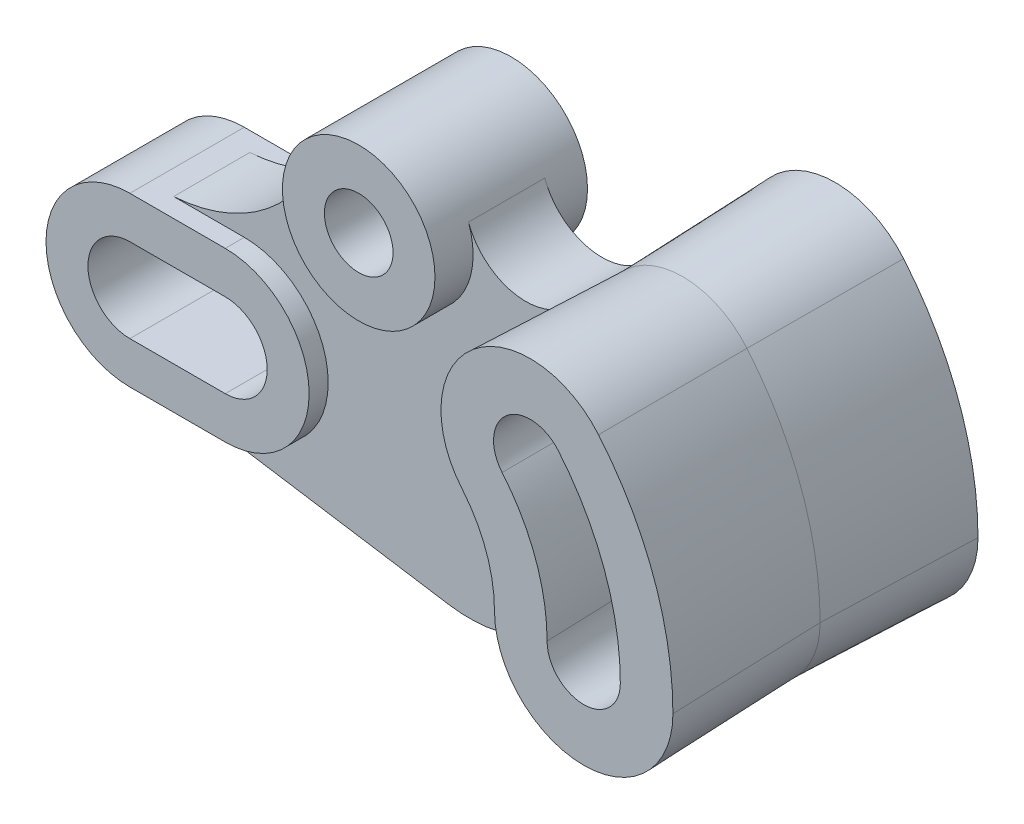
ISO-10303-21;
HEADER;
FILE_DESCRIPTION(('STEP AP214'),'2;1');
FILE_NAME('part.step','',(''),(''),'','','');
FILE_SCHEMA(('AUTOMOTIVE_DESIGN { 1 0 10303 214 1 1 1 1 }'));
ENDSEC;
DATA;
#1=APPLICATION_CONTEXT('core data for automotive mechanical design processes');
#2=APPLICATION_PROTOCOL_DEFINITION('international standard','automotive_design',2000,#1);
#3=PRODUCT_CONTEXT('',#1,'mechanical');
#4=PRODUCT('Part','Part','',(#3));
#5=PRODUCT_RELATED_PRODUCT_CATEGORY('part','',(#4));
#6=PRODUCT_DEFINITION_FORMATION('','',#4);
#7=PRODUCT_DEFINITION_CONTEXT('part definition',#1,'design');
#8=PRODUCT_DEFINITION('design','',#6,#7);
#9=PRODUCT_DEFINITION_SHAPE('','',#8);
#10=(LENGTH_UNIT() NAMED_UNIT(*) SI_UNIT(.MILLI.,.METRE.));
#11=(NAMED_UNIT(*) PLANE_ANGLE_UNIT() SI_UNIT($,.RADIAN.));
#12=(NAMED_UNIT(*) SI_UNIT($,.STERADIAN.) SOLID_ANGLE_UNIT());
#13=UNCERTAINTY_MEASURE_WITH_UNIT(LENGTH_MEASURE(1.E-05),#10,'distance_accuracy_value','');
#14=(GEOMETRIC_REPRESENTATION_CONTEXT(3) GLOBAL_UNCERTAINTY_ASSIGNED_CONTEXT((#13)) GLOBAL_UNIT_ASSIGNED_CONTEXT((#10,
#11,#12)) REPRESENTATION_CONTEXT('',''));
#15=CARTESIAN_POINT('',(0.,0.,0.));
#16=DIRECTION('',(0.,0.,1.));
#17=DIRECTION('',(1.,0.,0.));
#18=AXIS2_PLACEMENT_3D('',#15,#16,#17);
#19=CARTESIAN_POINT('',(111.141666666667,-32.0864186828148,10.));
#20=DIRECTION('',(0.,0.,-1.));
#21=DIRECTION('',(-1.,0.,0.));
#22=AXIS2_PLACEMENT_3D('',#19,#20,#21);
#23=CYLINDRICAL_SURFACE('',#22,16.);
#24=CARTESIAN_POINT('',(119.713796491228,-18.5764745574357,-8.67191904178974E-08));
#25=CARTESIAN_POINT('',(119.696706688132,-18.5656294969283,7.70544047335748E-05));
#26=CARTESIAN_POINT('',(119.679667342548,-18.5548648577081,-0.00186757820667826));
#27=CARTESIAN_POINT('',(119.646319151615,-18.533881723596,-0.00920876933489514));
#28=CARTESIAN_POINT('',(119.630003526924,-18.5236577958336,-0.0145580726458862));
#29=CARTESIAN_POINT('',(119.5932112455,-18.5006905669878,-0.0302988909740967));
#30=CARTESIAN_POINT('',(119.573055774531,-18.4881764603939,-0.0417514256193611));
#31=CARTESIAN_POINT('',(119.534389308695,-18.4642776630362,-0.0682480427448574));
#32=CARTESIAN_POINT('',(119.51588924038,-18.4529004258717,-0.0833138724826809));
#33=CARTESIAN_POINT('',(119.465545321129,-18.4220664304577,-0.129600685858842));
#34=CARTESIAN_POINT('',(119.435623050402,-18.4038983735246,-0.16372184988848));
#35=CARTESIAN_POINT('',(119.37982030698,-18.3702284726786,-0.236206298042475));
#36=CARTESIAN_POINT('',(119.353950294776,-18.3547335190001,-0.274580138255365));
#37=CARTESIAN_POINT('',(119.277405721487,-18.3091369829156,-0.398552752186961));
#38=CARTESIAN_POINT('',(119.23180383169,-18.2823568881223,-0.48843585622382));
#39=CARTESIAN_POINT('',(119.147747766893,-18.2334423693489,-0.672774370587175));
#40=CARTESIAN_POINT('',(119.10932241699,-18.2113266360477,-0.767246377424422));
#41=CARTESIAN_POINT('',(119.036949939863,-18.170016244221,-0.959471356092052));
#42=CARTESIAN_POINT('',(119.003043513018,-18.1508479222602,-1.0572453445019));
#43=CARTESIAN_POINT('',(118.938729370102,-18.1147633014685,-1.25408718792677));
#44=CARTESIAN_POINT('',(118.908314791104,-18.0978425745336,-1.35315206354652));
#45=CARTESIAN_POINT('',(118.821891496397,-18.0500916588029,-1.64830779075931));
#46=CARTESIAN_POINT('',(118.769490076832,-18.0215861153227,-1.84582588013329));
#47=CARTESIAN_POINT('',(118.670864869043,-17.9685491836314,-2.24294531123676));
#48=CARTESIAN_POINT('',(118.624643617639,-17.9440194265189,-2.44254747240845));
#49=CARTESIAN_POINT('',(118.492326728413,-17.8745262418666,-3.04394210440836));
#50=CARTESIAN_POINT('',(118.412758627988,-17.8337572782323,-3.44764529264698));
#51=CARTESIAN_POINT('',(118.264186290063,-17.7589480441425,-4.25535739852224));
#52=CARTESIAN_POINT('',(118.195130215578,-17.7248744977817,-4.65935424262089));
#53=CARTESIAN_POINT('',(118.064047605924,-17.6612337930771,-5.46849024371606));
#54=CARTESIAN_POINT('',(118.00201527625,-17.6316629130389,-5.87362817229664));
#55=CARTESIAN_POINT('',(117.897219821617,-17.5824542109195,-6.58830746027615));
#56=CARTESIAN_POINT('',(117.853384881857,-17.5621275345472,-6.89764746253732));
#57=CARTESIAN_POINT('',(117.768151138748,-17.5230432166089,-7.5168402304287));
#58=CARTESIAN_POINT('',(117.726752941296,-17.5042859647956,-7.82669310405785));
#59=CARTESIAN_POINT('',(117.645962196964,-17.4680705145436,-8.44703957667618));
#60=CARTESIAN_POINT('',(117.606571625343,-17.4506135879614,-8.75753350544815));
#61=CARTESIAN_POINT('',(117.529564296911,-17.4168408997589,-9.37871511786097));
#62=CARTESIAN_POINT('',(117.491947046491,-17.4005248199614,-9.68940272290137));
#63=CARTESIAN_POINT('',(117.455068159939,-17.3846853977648,-10.0002));
#64=B_SPLINE_CURVE_WITH_KNOTS('',3,(#24,#25,#26,#27,#28,#29,#30,#31,#32,#33,#34,#35,#36,#37,#38,
#39,#40,#41,#42,#43,#44,#45,#46,#47,#48,#49,#50,#51,#52,#53,#54,#55,#56,#57,#58,#59,#60,#61,#62,
#63),.UNSPECIFIED.,.F.,.F.,(4,2,2,2,2,2,2,2,2,2,2,2,2,2,2,2,2,2,2,4),(0.,0.0604865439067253,
0.120151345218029,0.198736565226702,0.277807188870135,0.423637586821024,0.569838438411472,
0.881542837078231,1.1944734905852,1.51005546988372,1.82500617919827,2.44372082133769,
3.06268865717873,4.30274528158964,5.5364736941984,6.76917676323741,7.70843683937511,
8.64792948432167,9.58832930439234,10.5284657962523),.UNSPECIFIED.);
#65=CARTESIAN_POINT('',(119.713596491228,-18.5763476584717,0.));
#66=VERTEX_POINT('',#65);
#67=CARTESIAN_POINT('',(117.455091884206,-17.3846955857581,-10.));
#68=VERTEX_POINT('',#67);
#69=EDGE_CURVE('E347',#66,#68,#64,.T.);
#70=ORIENTED_EDGE('',*,*,#69,.F.);
#71=CARTESIAN_POINT('',(119.713796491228,-18.5764745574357,8.67191904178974E-08));
#72=CARTESIAN_POINT('',(119.696706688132,-18.5656294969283,-7.70544047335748E-05));
#73=CARTESIAN_POINT('',(119.679667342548,-18.5548648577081,0.00186757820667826));
#74=CARTESIAN_POINT('',(119.646319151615,-18.533881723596,0.00920876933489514));
#75=CARTESIAN_POINT('',(119.630003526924,-18.5236577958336,0.0145580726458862));
#76=CARTESIAN_POINT('',(119.5932112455,-18.5006905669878,0.0302988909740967));
#77=CARTESIAN_POINT('',(119.573055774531,-18.4881764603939,0.0417514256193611));
#78=CARTESIAN_POINT('',(119.534389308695,-18.4642776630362,0.0682480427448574));
#79=CARTESIAN_POINT('',(119.51588924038,-18.4529004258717,0.0833138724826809));
#80=CARTESIAN_POINT('',(119.465545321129,-18.4220664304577,0.129600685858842));
#81=CARTESIAN_POINT('',(119.435623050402,-18.4038983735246,0.16372184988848));
#82=CARTESIAN_POINT('',(119.37982030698,-18.3702284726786,0.236206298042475));
#83=CARTESIAN_POINT('',(119.353950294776,-18.3547335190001,0.274580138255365));
#84=CARTESIAN_POINT('',(119.277405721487,-18.3091369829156,0.398552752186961));
#85=CARTESIAN_POINT('',(119.23180383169,-18.2823568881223,0.48843585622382));
#86=CARTESIAN_POINT('',(119.147747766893,-18.2334423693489,0.672774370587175));
#87=CARTESIAN_POINT('',(119.10932241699,-18.2113266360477,0.767246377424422));
#88=CARTESIAN_POINT('',(119.036949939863,-18.170016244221,0.959471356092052));
#89=CARTESIAN_POINT('',(119.003043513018,-18.1508479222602,1.0572453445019));
#90=CARTESIAN_POINT('',(118.938729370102,-18.1147633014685,1.25408718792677));
#91=CARTESIAN_POINT('',(118.908314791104,-18.0978425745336,1.35315206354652));
#92=CARTESIAN_POINT('',(118.821891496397,-18.0500916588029,1.64830779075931));
#93=CARTESIAN_POINT('',(118.769490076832,-18.0215861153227,1.84582588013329));
#94=CARTESIAN_POINT('',(118.670864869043,-17.9685491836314,2.24294531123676));
#95=CARTESIAN_POINT('',(118.624643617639,-17.9440194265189,2.44254747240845));
#96=CARTESIAN_POINT('',(118.492326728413,-17.8745262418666,3.04394210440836));
#97=CARTESIAN_POINT('',(118.412758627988,-17.8337572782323,3.44764529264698));
#98=CARTESIAN_POINT('',(118.264186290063,-17.7589480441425,4.25535739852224));
#99=CARTESIAN_POINT('',(118.195130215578,-17.7248744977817,4.65935424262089));
#100=CARTESIAN_POINT('',(118.064047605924,-17.6612337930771,5.46849024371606));
#101=CARTESIAN_POINT('',(118.00201527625,-17.6316629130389,5.87362817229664));
#102=CARTESIAN_POINT('',(117.897219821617,-17.5824542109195,6.58830746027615));
#103=CARTESIAN_POINT('',(117.853384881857,-17.5621275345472,6.89764746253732));
#104=CARTESIAN_POINT('',(117.768151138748,-17.5230432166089,7.5168402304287));
#105=CARTESIAN_POINT('',(117.726752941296,-17.5042859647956,7.82669310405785));
#106=CARTESIAN_POINT('',(117.645962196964,-17.4680705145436,8.44703957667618));
#107=CARTESIAN_POINT('',(117.606571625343,-17.4506135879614,8.75753350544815));
#108=CARTESIAN_POINT('',(117.529564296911,-17.4168408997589,9.37871511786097));
#109=CARTESIAN_POINT('',(117.491947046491,-17.4005248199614,9.68940272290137));
#110=CARTESIAN_POINT('',(117.455068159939,-17.3846853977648,10.0002));
#111=B_SPLINE_CURVE_WITH_KNOTS('',3,(#71,#72,#73,#74,#75,#76,#77,#78,#79,#80,#81,#82,#83,#84,
#85,#86,#87,#88,#89,#90,#91,#92,#93,#94,#95,#96,#97,#98,#99,#100,#101,#102,#103,#104,#105,#106,
#107,#108,#109,#110),.UNSPECIFIED.,.F.,.F.,(4,2,2,2,2,2,2,2,2,2,2,2,2,2,2,2,2,2,2,4),(0.,
0.0604865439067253,0.120151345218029,0.198736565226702,0.277807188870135,0.423637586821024,
0.569838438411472,0.881542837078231,1.1944734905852,1.51005546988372,1.82500617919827,
2.44372082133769,3.06268865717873,4.30274528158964,5.5364736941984,6.76917676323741,
7.70843683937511,8.64792948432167,9.58832930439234,10.5284657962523),.UNSPECIFIED.);
#112=CARTESIAN_POINT('',(117.455091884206,-17.3846955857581,10.));
#113=VERTEX_POINT('',#112);
#114=EDGE_CURVE('E283',#66,#113,#111,.T.);
#115=ORIENTED_EDGE('',*,*,#114,.T.);
#116=CARTESIAN_POINT('',(111.141666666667,-32.0864186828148,10.));
#117=DIRECTION('',(0.,0.,1.));
#118=DIRECTION('',(1.,0.,0.));
#119=AXIS2_PLACEMENT_3D('',#116,#117,#118);
#120=CIRCLE('',#119,16.);
#121=CARTESIAN_POINT('',(98.7050653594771,-22.0200912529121,10.));
#122=VERTEX_POINT('',#121);
#123=EDGE_CURVE('E474',#122,#113,#120,.F.);
#124=ORIENTED_EDGE('',*,*,#123,.F.);
#125=DIRECTION('',(0.,0.,-1.));
#126=VECTOR('',#125,1.);
#127=CARTESIAN_POINT('',(98.7050653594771,-22.0200912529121,10.));
#128=LINE('',#127,#126);
#129=CARTESIAN_POINT('',(98.7050653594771,-22.0200912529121,-10.));
#130=VERTEX_POINT('',#129);
#131=EDGE_CURVE('E445',#122,#130,#128,.T.);
#132=ORIENTED_EDGE('',*,*,#131,.T.);
#133=CARTESIAN_POINT('',(111.141666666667,-32.0864186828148,-10.));
#134=DIRECTION('',(0.,0.,1.));
#135=DIRECTION('',(1.,0.,0.));
#136=AXIS2_PLACEMENT_3D('',#133,#134,#135);
#137=CIRCLE('',#136,16.);
#138=EDGE_CURVE('E417',#130,#68,#137,.F.);
#139=ORIENTED_EDGE('',*,*,#138,.T.);
#140=EDGE_LOOP('',(#70,#115,#124,#132,#139));
#141=FACE_BOUND('',#140,.T.);
#142=ADVANCED_FACE('F30',(#141),#23,.F.);
#143=CARTESIAN_POINT('',(86.3188881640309,60.3402918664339,10.));
#144=DIRECTION('',(0.,0.,-1.));
#145=DIRECTION('',(-1.,0.,0.));
#146=AXIS2_PLACEMENT_3D('',#143,#144,#145);
#147=CYLINDRICAL_SURFACE('',#146,16.);
#148=CARTESIAN_POINT('',(86.3188881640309,60.3402918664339,10.));
#149=DIRECTION('',(0.,0.,1.));
#150=DIRECTION('',(1.,0.,0.));
#151=AXIS2_PLACEMENT_3D('',#148,#149,#150);
#152=CIRCLE('',#151,16.);
#153=CARTESIAN_POINT('',(71.2882712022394,54.8557177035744,10.));
#154=VERTEX_POINT('',#153);
#155=CARTESIAN_POINT('',(97.8065651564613,49.2032690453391,10.));
#156=VERTEX_POINT('',#155);
#157=EDGE_CURVE('E426',#154,#156,#152,.T.);
#158=ORIENTED_EDGE('',*,*,#157,.T.);
#159=CARTESIAN_POINT('',(97.8065471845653,49.2032505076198,10.0002));
#160=CARTESIAN_POINT('',(97.857432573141,49.2557881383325,9.43532356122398));
#161=CARTESIAN_POINT('',(97.9097865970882,49.3104637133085,8.87073606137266));
#162=CARTESIAN_POINT('',(98.0190188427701,49.4263745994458,7.74253909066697));
#163=CARTESIAN_POINT('',(98.0758981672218,49.4876115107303,7.17892989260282));
#164=CARTESIAN_POINT('',(98.1760989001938,49.5973832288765,6.23787319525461));
#165=CARTESIAN_POINT('',(98.2177516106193,49.6435003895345,5.85997209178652));
#166=CARTESIAN_POINT('',(98.3047347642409,49.7410596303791,5.10530579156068));
#167=CARTESIAN_POINT('',(98.3500650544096,49.7925014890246,4.72854054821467));
#168=CARTESIAN_POINT('',(98.4622935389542,49.9216718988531,3.845889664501));
#169=CARTESIAN_POINT('',(98.5312112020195,50.0023217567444,3.34065097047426));
#170=CARTESIAN_POINT('',(98.6603495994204,50.1572197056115,2.49933532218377));
#171=CARTESIAN_POINT('',(98.716164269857,50.2250894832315,2.16144025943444));
#172=CARTESIAN_POINT('',(98.8213091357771,50.3555939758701,1.59928776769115));
#173=CARTESIAN_POINT('',(98.8670011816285,50.4129569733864,1.37325888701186));
#174=CARTESIAN_POINT('',(98.9537535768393,50.5238080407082,0.998765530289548));
#175=CARTESIAN_POINT('',(98.9917613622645,50.572854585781,0.848236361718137));
#176=CARTESIAN_POINT('',(99.074735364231,50.68145449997,0.562744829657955));
#177=CARTESIAN_POINT('',(99.1191461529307,50.7401993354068,0.427390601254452));
#178=CARTESIAN_POINT('',(99.1851511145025,50.8292641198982,0.27590887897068));
#179=CARTESIAN_POINT('',(99.1978277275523,50.8464301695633,0.248532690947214));
#180=CARTESIAN_POINT('',(99.2245469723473,50.8827819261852,0.195639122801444));
#181=CARTESIAN_POINT('',(99.2385949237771,50.9019755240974,0.170129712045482));
#182=CARTESIAN_POINT('',(99.2685737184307,50.9431485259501,0.121730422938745));
#183=CARTESIAN_POINT('',(99.2845320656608,50.9651690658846,0.0988913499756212));
#184=CARTESIAN_POINT('',(99.3183543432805,51.0121246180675,0.0585600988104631));
#185=CARTESIAN_POINT('',(99.3361951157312,51.0370245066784,0.0410112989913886));
#186=CARTESIAN_POINT('',(99.3671667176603,51.0805478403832,0.0189654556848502));
#187=CARTESIAN_POINT('',(99.3797477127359,51.09829942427,0.0120488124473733));
#188=CARTESIAN_POINT('',(99.4056169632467,51.1349640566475,0.00246113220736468));
#189=CARTESIAN_POINT('',(99.4189144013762,51.1538933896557,-0.000120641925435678));
#190=CARTESIAN_POINT('',(99.432258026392,51.1729841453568,1.88334128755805E-07));
#191=B_SPLINE_CURVE_WITH_KNOTS('',3,(#159,#160,#161,#162,#163,#164,#165,#166,#167,#168,#169,
#170,#171,#172,#173,#174,#175,#176,#177,#178,#179,#180,#181,#182,#183,#184,#185,#186,#187,#188,
#189,#190),.UNSPECIFIED.,.F.,.F.,(4,2,2,2,2,2,2,2,2,2,2,2,2,2,2,4),(0.,1.70883434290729,
3.4180863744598,4.56696363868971,5.71579312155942,7.26400978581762,8.31107084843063,
9.02315262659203,9.51158558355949,9.97066619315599,10.0746966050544,10.1791479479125,
10.2853419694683,10.3903553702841,10.4584416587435,10.5279135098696),.UNSPECIFIED.);
#192=CARTESIAN_POINT('',(99.4320580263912,51.1726980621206,0.));
#193=VERTEX_POINT('',#192);
#194=EDGE_CURVE('E400',#156,#193,#191,.T.);
#195=ORIENTED_EDGE('',*,*,#194,.T.);
#196=CARTESIAN_POINT('',(97.8065471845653,49.2032505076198,-10.0002));
#197=CARTESIAN_POINT('',(97.857432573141,49.2557881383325,-9.43532356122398));
#198=CARTESIAN_POINT('',(97.9097865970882,49.3104637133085,-8.87073606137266));
#199=CARTESIAN_POINT('',(98.0190188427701,49.4263745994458,-7.74253909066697));
#200=CARTESIAN_POINT('',(98.0758981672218,49.4876115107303,-7.17892989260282));
#201=CARTESIAN_POINT('',(98.1760989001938,49.5973832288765,-6.23787319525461));
#202=CARTESIAN_POINT('',(98.2177516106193,49.6435003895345,-5.85997209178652));
#203=CARTESIAN_POINT('',(98.3047347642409,49.7410596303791,-5.10530579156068));
#204=CARTESIAN_POINT('',(98.3500650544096,49.7925014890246,-4.72854054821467));
#205=CARTESIAN_POINT('',(98.4622935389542,49.9216718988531,-3.845889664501));
#206=CARTESIAN_POINT('',(98.5312112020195,50.0023217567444,-3.34065097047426));
#207=CARTESIAN_POINT('',(98.6603495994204,50.1572197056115,-2.49933532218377));
#208=CARTESIAN_POINT('',(98.716164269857,50.2250894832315,-2.16144025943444));
#209=CARTESIAN_POINT('',(98.8213091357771,50.3555939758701,-1.59928776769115));
#210=CARTESIAN_POINT('',(98.8670011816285,50.4129569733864,-1.37325888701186));
#211=CARTESIAN_POINT('',(98.9537535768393,50.5238080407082,-0.998765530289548));
#212=CARTESIAN_POINT('',(98.9917613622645,50.572854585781,-0.848236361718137));
#213=CARTESIAN_POINT('',(99.074735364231,50.68145449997,-0.562744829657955));
#214=CARTESIAN_POINT('',(99.1191461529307,50.7401993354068,-0.427390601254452));
#215=CARTESIAN_POINT('',(99.1851511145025,50.8292641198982,-0.27590887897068));
#216=CARTESIAN_POINT('',(99.1978277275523,50.8464301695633,-0.248532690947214));
#217=CARTESIAN_POINT('',(99.2245469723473,50.8827819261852,-0.195639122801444));
#218=CARTESIAN_POINT('',(99.2385949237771,50.9019755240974,-0.170129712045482));
#219=CARTESIAN_POINT('',(99.2685737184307,50.9431485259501,-0.121730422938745));
#220=CARTESIAN_POINT('',(99.2845320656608,50.9651690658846,-0.0988913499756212));
#221=CARTESIAN_POINT('',(99.3183543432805,51.0121246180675,-0.0585600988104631));
#222=CARTESIAN_POINT('',(99.3361951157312,51.0370245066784,-0.0410112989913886));
#223=CARTESIAN_POINT('',(99.3671667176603,51.0805478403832,-0.0189654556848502));
#224=CARTESIAN_POINT('',(99.3797477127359,51.09829942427,-0.0120488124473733));
#225=CARTESIAN_POINT('',(99.4056169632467,51.1349640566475,-0.00246113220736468));
#226=CARTESIAN_POINT('',(99.4189144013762,51.1538933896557,0.000120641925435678));
#227=CARTESIAN_POINT('',(99.432258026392,51.1729841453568,-1.88334128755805E-07));
#228=B_SPLINE_CURVE_WITH_KNOTS('',3,(#196,#197,#198,#199,#200,#201,#202,#203,#204,#205,#206,
#207,#208,#209,#210,#211,#212,#213,#214,#215,#216,#217,#218,#219,#220,#221,#222,#223,#224,#225,
#226,#227),.UNSPECIFIED.,.F.,.F.,(4,2,2,2,2,2,2,2,2,2,2,2,2,2,2,4),(0.,1.70883434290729,
3.4180863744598,4.56696363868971,5.71579312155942,7.26400978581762,8.31107084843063,
9.02315262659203,9.51158558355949,9.97066619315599,10.0746966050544,10.1791479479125,
10.2853419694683,10.3903553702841,10.4584416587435,10.5279135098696),.UNSPECIFIED.);
#229=CARTESIAN_POINT('',(97.8065651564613,49.2032690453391,-10.));
#230=VERTEX_POINT('',#229);
#231=EDGE_CURVE('E335',#230,#193,#228,.T.);
#232=ORIENTED_EDGE('',*,*,#231,.F.);
#233=CARTESIAN_POINT('',(86.3188881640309,60.3402918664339,-10.));
#234=DIRECTION('',(0.,0.,1.));
#235=DIRECTION('',(1.,0.,0.));
#236=AXIS2_PLACEMENT_3D('',#233,#234,#235);
#237=CIRCLE('',#236,16.);
#238=CARTESIAN_POINT('',(71.2882712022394,54.8557177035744,-10.));
#239=VERTEX_POINT('',#238);
#240=EDGE_CURVE('E497',#239,#230,#237,.T.);
#241=ORIENTED_EDGE('',*,*,#240,.F.);
#242=DIRECTION('',(0.,0.,-1.));
#243=VECTOR('',#242,1.);
#244=CARTESIAN_POINT('',(71.2882712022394,54.8557177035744,10.));
#245=LINE('',#244,#243);
#246=EDGE_CURVE('E447',#154,#239,#245,.T.);
#247=ORIENTED_EDGE('',*,*,#246,.F.);
#248=EDGE_LOOP('',(#158,#195,#232,#241,#247));
#249=FACE_BOUND('',#248,.T.);
#250=ADVANCED_FACE('F353',(#249),#147,.F.);
#251=CARTESIAN_POINT('',(59.5,-150.011242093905,-10.));
#252=DIRECTION('',(0.,0.,1.));
#253=DIRECTION('',(1.,0.,0.));
#254=AXIS2_PLACEMENT_3D('',#251,#252,#253);
#255=PLANE('',#254);
#256=CARTESIAN_POINT('',(131.5,0.,-10.));
#257=DIRECTION('',(0.,0.,1.));
#258=DIRECTION('',(1.,0.,0.));
#259=AXIS2_PLACEMENT_3D('',#256,#257,#258);
#260=CIRCLE('',#259,22.3492076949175);
#261=CARTESIAN_POINT('',(109.150792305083,0.,-10.));
#262=VERTEX_POINT('',#261);
#263=EDGE_CURVE('E436',#68,#262,#260,.F.);
#264=ORIENTED_EDGE('',*,*,#263,.F.);
#265=ORIENTED_EDGE('',*,*,#138,.F.);
#266=CARTESIAN_POINT('',(71.5,0.,-10.));
#267=DIRECTION('',(0.,0.,1.));
#268=DIRECTION('',(1.,0.,0.));
#269=AXIS2_PLACEMENT_3D('',#266,#267,#268);
#270=CIRCLE('',#269,35.);
#271=CARTESIAN_POINT('',(66.0833333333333,-34.5783128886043,-10.));
#272=VERTEX_POINT('',#271);
#273=EDGE_CURVE('E500',#272,#130,#270,.T.);
#274=ORIENTED_EDGE('',*,*,#273,.F.);
#275=DIRECTION('',(0.987951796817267,-0.154761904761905,0.));
#276=VECTOR('',#275,1.);
#277=CARTESIAN_POINT('',(77.3070624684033,-36.3365016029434,-10.));
#278=LINE('',#277,#276);
#279=CARTESIAN_POINT('',(-15.9047619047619,-21.7349395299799,-10.));
#280=VERTEX_POINT('',#279);
#281=EDGE_CURVE('E478',#280,#272,#278,.T.);
#282=ORIENTED_EDGE('',*,*,#281,.F.);
#283=CARTESIAN_POINT('',(-12.5,0.,-10.));
#284=DIRECTION('',(0.,0.,1.));
#285=DIRECTION('',(1.,0.,0.));
#286=AXIS2_PLACEMENT_3D('',#283,#284,#285);
#287=CIRCLE('',#286,22.);
#288=CARTESIAN_POINT('',(-12.5,-22.,-10.));
#289=VERTEX_POINT('',#288);
#290=EDGE_CURVE('E480',#289,#280,#287,.F.);
#291=ORIENTED_EDGE('',*,*,#290,.F.);
#292=DIRECTION('',(-1.,0.,0.));
#293=VECTOR('',#292,1.);
#294=CARTESIAN_POINT('',(59.5,-22.,-10.));
#295=LINE('',#294,#293);
#296=CARTESIAN_POINT('',(12.5,-22.,-10.));
#297=VERTEX_POINT('',#296);
#298=EDGE_CURVE('E483',#297,#289,#295,.T.);
#299=ORIENTED_EDGE('',*,*,#298,.F.);
#300=CARTESIAN_POINT('',(12.5,0.,-10.));
#301=DIRECTION('',(0.,0.,1.));
#302=DIRECTION('',(1.,0.,0.));
#303=AXIS2_PLACEMENT_3D('',#300,#301,#302);
#304=CIRCLE('',#303,22.);
#305=CARTESIAN_POINT('',(12.5,22.,-10.));
#306=VERTEX_POINT('',#305);
#307=EDGE_CURVE('E486',#306,#297,#304,.F.);
#308=ORIENTED_EDGE('',*,*,#307,.F.);
#309=DIRECTION('',(1.,0.,0.));
#310=VECTOR('',#309,1.);
#311=CARTESIAN_POINT('',(59.5,22.,-10.));
#312=LINE('',#311,#310);
#313=CARTESIAN_POINT('',(-6.04218392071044,22.,-10.));
#314=VERTEX_POINT('',#313);
#315=EDGE_CURVE('E489',#314,#306,#312,.T.);
#316=ORIENTED_EDGE('',*,*,#315,.F.);
#317=CARTESIAN_POINT('',(-8.94461571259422,65.9041671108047,-10.));
#318=DIRECTION('',(0.,0.,1.));
#319=DIRECTION('',(1.,0.,0.));
#320=AXIS2_PLACEMENT_3D('',#317,#318,#319);
#321=CIRCLE('',#320,44.);
#322=CARTESIAN_POINT('',(33.2985575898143,53.5950522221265,-10.));
#323=VERTEX_POINT('',#322);
#324=EDGE_CURVE('E492',#323,#314,#321,.F.);
#325=ORIENTED_EDGE('',*,*,#324,.F.);
#326=CARTESIAN_POINT('',(52.5,48.,-10.));
#327=DIRECTION('',(0.,0.,1.));
#328=DIRECTION('',(1.,0.,0.));
#329=AXIS2_PLACEMENT_3D('',#326,#327,#328);
#330=CIRCLE('',#329,20.);
#331=EDGE_CURVE('E494',#323,#239,#330,.T.);
#332=ORIENTED_EDGE('',*,*,#331,.T.);
#333=ORIENTED_EDGE('',*,*,#240,.T.);
#334=CARTESIAN_POINT('',(117.462666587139,38.5672565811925,-10.));
#335=DIRECTION('',(0.,0.,1.));
#336=DIRECTION('',(1.,0.,0.));
#337=AXIS2_PLACEMENT_3D('',#334,#335,#336);
#338=CIRCLE('',#337,22.3492076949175);
#339=CARTESIAN_POINT('',(100.342180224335,24.2014627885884,-10.));
#340=VERTEX_POINT('',#339);
#341=EDGE_CURVE('E442',#230,#340,#338,.T.);
#342=ORIENTED_EDGE('',*,*,#341,.T.);
#343=CARTESIAN_POINT('',(71.5,0.,-10.));
#344=DIRECTION('',(0.,0.,1.));
#345=DIRECTION('',(1.,0.,0.));
#346=AXIS2_PLACEMENT_3D('',#343,#344,#345);
#347=CIRCLE('',#346,37.6507923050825);
#348=EDGE_CURVE('E440',#262,#340,#347,.T.);
#349=ORIENTED_EDGE('',*,*,#348,.F.);
#350=EDGE_LOOP('',(#264,#265,#274,#282,#291,#299,#308,#316,#325,#332,#333,#342,#349));
#351=FACE_BOUND('',#350,.T.);
#352=ADVANCED_FACE('F412',(#351),#255,.F.);
#353=CARTESIAN_POINT('',(71.5,0.,10.));
#354=DIRECTION('',(0.,0.,-1.));
#355=DIRECTION('',(-1.,0.,0.));
#356=AXIS2_PLACEMENT_3D('',#353,#354,#355);
#357=CYLINDRICAL_SURFACE('',#356,35.);
#358=ORIENTED_EDGE('',*,*,#273,.T.);
#359=ORIENTED_EDGE('',*,*,#131,.F.);
#360=CARTESIAN_POINT('',(71.5,0.,10.));
#361=DIRECTION('',(0.,0.,1.));
#362=DIRECTION('',(1.,0.,0.));
#363=AXIS2_PLACEMENT_3D('',#360,#361,#362);
#364=CIRCLE('',#363,35.);
#365=CARTESIAN_POINT('',(66.0833333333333,-34.5783128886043,10.));
#366=VERTEX_POINT('',#365);
#367=EDGE_CURVE('E476',#366,#122,#364,.T.);
#368=ORIENTED_EDGE('',*,*,#367,.F.);
#369=DIRECTION('',(0.,0.,-1.));
#370=VECTOR('',#369,1.);
#371=CARTESIAN_POINT('',(66.0833333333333,-34.5783128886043,10.));
#372=LINE('',#371,#370);
#373=EDGE_CURVE('E457',#366,#272,#372,.T.);
#374=ORIENTED_EDGE('',*,*,#373,.T.);
#375=EDGE_LOOP('',(#358,#359,#368,#374));
#376=FACE_BOUND('',#375,.T.);
#377=ADVANCED_FACE('F32',(#376),#357,.T.);
#378=CARTESIAN_POINT('',(-8.94461571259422,65.9041671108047,10.));
#379=DIRECTION('',(0.,0.,-1.));
#380=DIRECTION('',(-1.,0.,0.));
#381=AXIS2_PLACEMENT_3D('',#378,#379,#380);
#382=CYLINDRICAL_SURFACE('',#381,44.);
#383=ORIENTED_EDGE('',*,*,#324,.T.);
#384=DIRECTION('',(0.,0.,-1.));
#385=VECTOR('',#384,1.);
#386=CARTESIAN_POINT('',(-6.04218392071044,22.,10.));
#387=LINE('',#386,#385);
#388=CARTESIAN_POINT('',(-6.04218392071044,22.,10.));
#389=VERTEX_POINT('',#388);
#390=EDGE_CURVE('E452',#389,#314,#387,.T.);
#391=ORIENTED_EDGE('',*,*,#390,.F.);
#392=CARTESIAN_POINT('',(-8.94461571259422,65.9041671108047,10.));
#393=DIRECTION('',(0.,0.,1.));
#394=DIRECTION('',(1.,0.,0.));
#395=AXIS2_PLACEMENT_3D('',#392,#393,#394);
#396=CIRCLE('',#395,44.);
#397=CARTESIAN_POINT('',(33.2985575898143,53.5950522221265,10.));
#398=VERTEX_POINT('',#397);
#399=EDGE_CURVE('E469',#398,#389,#396,.F.);
#400=ORIENTED_EDGE('',*,*,#399,.F.);
#401=DIRECTION('',(0.,0.,-1.));
#402=VECTOR('',#401,1.);
#403=CARTESIAN_POINT('',(33.2985575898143,53.5950522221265,10.));
#404=LINE('',#403,#402);
#405=EDGE_CURVE('E449',#398,#323,#404,.T.);
#406=ORIENTED_EDGE('',*,*,#405,.T.);
#407=EDGE_LOOP('',(#383,#391,#400,#406));
#408=FACE_BOUND('',#407,.T.);
#409=ADVANCED_FACE('F647',(#408),#382,.F.);
#410=CARTESIAN_POINT('',(77.3070624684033,-36.3365016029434,10.));
#411=DIRECTION('',(0.154761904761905,0.987951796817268,0.));
#412=DIRECTION('',(-0.987951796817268,0.154761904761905,0.));
#413=AXIS2_PLACEMENT_3D('',#410,#411,#412);
#414=PLANE('',#413);
#415=ORIENTED_EDGE('',*,*,#281,.T.);
#416=ORIENTED_EDGE('',*,*,#373,.F.);
#417=DIRECTION('',(0.987951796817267,-0.154761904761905,0.));
#418=VECTOR('',#417,1.);
#419=CARTESIAN_POINT('',(77.3070624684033,-36.3365016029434,10.));
#420=LINE('',#419,#418);
#421=CARTESIAN_POINT('',(-15.9047619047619,-21.7349395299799,10.));
#422=VERTEX_POINT('',#421);
#423=EDGE_CURVE('E53',#422,#366,#420,.T.);
#424=ORIENTED_EDGE('',*,*,#423,.F.);
#425=DIRECTION('',(0.,0.,-1.));
#426=VECTOR('',#425,1.);
#427=CARTESIAN_POINT('',(-15.9047619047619,-21.7349395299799,10.));
#428=LINE('',#427,#426);
#429=EDGE_CURVE('E455',#422,#280,#428,.T.);
#430=ORIENTED_EDGE('',*,*,#429,.T.);
#431=EDGE_LOOP('',(#415,#416,#424,#430));
#432=FACE_BOUND('',#431,.T.);
#433=ADVANCED_FACE('F645',(#432),#414,.F.);
#434=CARTESIAN_POINT('',(59.5,-150.011242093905,10.));
#435=DIRECTION('',(0.,0.,1.));
#436=DIRECTION('',(1.,0.,0.));
#437=AXIS2_PLACEMENT_3D('',#434,#435,#436);
#438=PLANE('',#437);
#439=CARTESIAN_POINT('',(131.5,0.,10.));
#440=DIRECTION('',(0.,0.,1.));
#441=DIRECTION('',(1.,0.,0.));
#442=AXIS2_PLACEMENT_3D('',#439,#440,#441);
#443=CIRCLE('',#442,22.3492076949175);
#444=CARTESIAN_POINT('',(109.150792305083,0.,10.));
#445=VERTEX_POINT('',#444);
#446=EDGE_CURVE('E11',#445,#113,#443,.T.);
#447=ORIENTED_EDGE('',*,*,#446,.F.);
#448=CARTESIAN_POINT('',(71.5,0.,10.));
#449=DIRECTION('',(0.,0.,1.));
#450=DIRECTION('',(1.,0.,0.));
#451=AXIS2_PLACEMENT_3D('',#448,#449,#450);
#452=CIRCLE('',#451,37.6507923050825);
#453=CARTESIAN_POINT('',(100.342180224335,24.2014627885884,10.));
#454=VERTEX_POINT('',#453);
#455=EDGE_CURVE('E435',#454,#445,#452,.F.);
#456=ORIENTED_EDGE('',*,*,#455,.F.);
#457=CARTESIAN_POINT('',(117.462666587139,38.5672565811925,10.));
#458=DIRECTION('',(0.,0.,1.));
#459=DIRECTION('',(1.,0.,0.));
#460=AXIS2_PLACEMENT_3D('',#457,#458,#459);
#461=CIRCLE('',#460,22.3492076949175);
#462=EDGE_CURVE('E38',#454,#156,#461,.F.);
#463=ORIENTED_EDGE('',*,*,#462,.T.);
#464=ORIENTED_EDGE('',*,*,#157,.F.);
#465=CARTESIAN_POINT('',(52.5,48.,10.));
#466=DIRECTION('',(0.,0.,1.));
#467=DIRECTION('',(1.,0.,0.));
#468=AXIS2_PLACEMENT_3D('',#465,#466,#467);
#469=CIRCLE('',#468,20.);
#470=EDGE_CURVE('E471',#398,#154,#469,.T.);
#471=ORIENTED_EDGE('',*,*,#470,.F.);
#472=ORIENTED_EDGE('',*,*,#399,.T.);
#473=DIRECTION('',(1.,0.,0.));
#474=VECTOR('',#473,1.);
#475=CARTESIAN_POINT('',(59.5,22.,10.));
#476=LINE('',#475,#474);
#477=CARTESIAN_POINT('',(12.5,22.,10.));
#478=VERTEX_POINT('',#477);
#479=EDGE_CURVE('E467',#389,#478,#476,.T.);
#480=ORIENTED_EDGE('',*,*,#479,.T.);
#481=CARTESIAN_POINT('',(12.5,0.,10.));
#482=DIRECTION('',(0.,0.,1.));
#483=DIRECTION('',(1.,0.,0.));
#484=AXIS2_PLACEMENT_3D('',#481,#482,#483);
#485=CIRCLE('',#484,22.);
#486=CARTESIAN_POINT('',(12.5,-22.,10.));
#487=VERTEX_POINT('',#486);
#488=EDGE_CURVE('E465',#478,#487,#485,.F.);
#489=ORIENTED_EDGE('',*,*,#488,.T.);
#490=DIRECTION('',(-1.,0.,0.));
#491=VECTOR('',#490,1.);
#492=CARTESIAN_POINT('',(59.5,-22.,10.));
#493=LINE('',#492,#491);
#494=CARTESIAN_POINT('',(-12.5,-22.,10.));
#495=VERTEX_POINT('',#494);
#496=EDGE_CURVE('E463',#487,#495,#493,.T.);
#497=ORIENTED_EDGE('',*,*,#496,.T.);
#498=CARTESIAN_POINT('',(-12.5,0.,10.));
#499=DIRECTION('',(0.,0.,1.));
#500=DIRECTION('',(1.,0.,0.));
#501=AXIS2_PLACEMENT_3D('',#498,#499,#500);
#502=CIRCLE('',#501,22.);
#503=EDGE_CURVE('E461',#495,#422,#502,.F.);
#504=ORIENTED_EDGE('',*,*,#503,.T.);
#505=ORIENTED_EDGE('',*,*,#423,.T.);
#506=ORIENTED_EDGE('',*,*,#367,.T.);
#507=ORIENTED_EDGE('',*,*,#123,.T.);
#508=EDGE_LOOP('',(#447,#456,#463,#464,#471,#472,#480,#489,#497,#504,#505,#506,#507));
#509=FACE_BOUND('',#508,.T.);
#510=ADVANCED_FACE('F433',(#509),#438,.T.);
#511=CARTESIAN_POINT('',(59.5,-22.,15.));
#512=DIRECTION('',(0.,-1.,0.));
#513=DIRECTION('',(0.,0.,-1.));
#514=AXIS2_PLACEMENT_3D('',#511,#512,#513);
#515=PLANE('',#514);
#516=ORIENTED_EDGE('',*,*,#298,.T.);
#517=DIRECTION('',(0.,0.,-1.));
#518=VECTOR('',#517,1.);
#519=CARTESIAN_POINT('',(-12.5,-22.,15.));
#520=LINE('',#519,#518);
#521=CARTESIAN_POINT('',(-12.5,-22.,-15.));
#522=VERTEX_POINT('',#521);
#523=EDGE_CURVE('E508',#289,#522,#520,.T.);
#524=ORIENTED_EDGE('',*,*,#523,.T.);
#525=DIRECTION('',(-1.,0.,0.));
#526=VECTOR('',#525,1.);
#527=CARTESIAN_POINT('',(59.5,-22.,-15.));
#528=LINE('',#527,#526);
#529=CARTESIAN_POINT('',(12.5,-22.,-15.));
#530=VERTEX_POINT('',#529);
#531=EDGE_CURVE('E565',#530,#522,#528,.T.);
#532=ORIENTED_EDGE('',*,*,#531,.F.);
#533=DIRECTION('',(0.,0.,-1.));
#534=VECTOR('',#533,1.);
#535=CARTESIAN_POINT('',(12.5,-22.,15.));
#536=LINE('',#535,#534);
#537=EDGE_CURVE('E512',#297,#530,#536,.T.);
#538=ORIENTED_EDGE('',*,*,#537,.F.);
#539=EDGE_LOOP('',(#516,#524,#532,#538));
#540=FACE_BOUND('',#539,.T.);
#541=ADVANCED_FACE('F636',(#540),#515,.T.);
#542=CARTESIAN_POINT('',(12.5,0.,15.));
#543=DIRECTION('',(0.,0.,-1.));
#544=DIRECTION('',(-1.,0.,0.));
#545=AXIS2_PLACEMENT_3D('',#542,#543,#544);
#546=CYLINDRICAL_SURFACE('',#545,22.);
#547=ORIENTED_EDGE('',*,*,#307,.T.);
#548=ORIENTED_EDGE('',*,*,#537,.T.);
#549=CARTESIAN_POINT('',(12.5,0.,-15.));
#550=DIRECTION('',(0.,0.,1.));
#551=DIRECTION('',(1.,0.,0.));
#552=AXIS2_PLACEMENT_3D('',#549,#550,#551);
#553=CIRCLE('',#552,22.);
#554=CARTESIAN_POINT('',(12.5,22.,-15.));
#555=VERTEX_POINT('',#554);
#556=EDGE_CURVE('E562',#555,#530,#553,.F.);
#557=ORIENTED_EDGE('',*,*,#556,.F.);
#558=DIRECTION('',(0.,0.,-1.));
#559=VECTOR('',#558,1.);
#560=CARTESIAN_POINT('',(12.5,22.,15.));
#561=LINE('',#560,#559);
#562=EDGE_CURVE('E516',#306,#555,#561,.T.);
#563=ORIENTED_EDGE('',*,*,#562,.F.);
#564=EDGE_LOOP('',(#547,#548,#557,#563));
#565=FACE_BOUND('',#564,.T.);
#566=ADVANCED_FACE('F623',(#565),#546,.T.);
#567=CARTESIAN_POINT('',(59.5,-11.,15.));
#568=DIRECTION('',(0.,-1.,0.));
#569=DIRECTION('',(1.,0.,0.));
#570=AXIS2_PLACEMENT_3D('',#567,#568,#569);
#571=PLANE('',#570);
#572=DIRECTION('',(-1.,0.,0.));
#573=VECTOR('',#572,1.);
#574=CARTESIAN_POINT('',(59.5,-11.,-15.));
#575=LINE('',#574,#573);
#576=CARTESIAN_POINT('',(12.5,-11.,-15.));
#577=VERTEX_POINT('',#576);
#578=CARTESIAN_POINT('',(-12.5,-11.,-15.));
#579=VERTEX_POINT('',#578);
#580=EDGE_CURVE('E556',#577,#579,#575,.T.);
#581=ORIENTED_EDGE('',*,*,#580,.T.);
#582=DIRECTION('',(0.,0.,-1.));
#583=VECTOR('',#582,1.);
#584=CARTESIAN_POINT('',(-12.5,-11.,15.));
#585=LINE('',#584,#583);
#586=CARTESIAN_POINT('',(-12.5,-11.,15.));
#587=VERTEX_POINT('',#586);
#588=EDGE_CURVE('E503',#587,#579,#585,.T.);
#589=ORIENTED_EDGE('',*,*,#588,.F.);
#590=DIRECTION('',(-1.,0.,0.));
#591=VECTOR('',#590,1.);
#592=CARTESIAN_POINT('',(59.5,-11.,15.));
#593=LINE('',#592,#591);
#594=CARTESIAN_POINT('',(12.5,-11.,15.));
#595=VERTEX_POINT('',#594);
#596=EDGE_CURVE('E535',#595,#587,#593,.T.);
#597=ORIENTED_EDGE('',*,*,#596,.F.);
#598=DIRECTION('',(0.,0.,-1.));
#599=VECTOR('',#598,1.);
#600=CARTESIAN_POINT('',(12.5,-11.,15.));
#601=LINE('',#600,#599);
#602=EDGE_CURVE('E507',#595,#577,#601,.T.);
#603=ORIENTED_EDGE('',*,*,#602,.T.);
#604=EDGE_LOOP('',(#581,#589,#597,#603));
#605=FACE_BOUND('',#604,.T.);
#606=ADVANCED_FACE('F619',(#605),#571,.F.);
#607=CARTESIAN_POINT('',(-12.5,0.,15.));
#608=DIRECTION('',(0.,0.,-1.));
#609=DIRECTION('',(-1.,0.,0.));
#610=AXIS2_PLACEMENT_3D('',#607,#608,#609);
#611=CYLINDRICAL_SURFACE('',#610,11.);
#612=CARTESIAN_POINT('',(-12.5,0.,-15.));
#613=DIRECTION('',(0.,0.,1.));
#614=DIRECTION('',(1.,0.,0.));
#615=AXIS2_PLACEMENT_3D('',#612,#613,#614);
#616=CIRCLE('',#615,11.);
#617=CARTESIAN_POINT('',(-12.5,11.,-15.));
#618=VERTEX_POINT('',#617);
#619=EDGE_CURVE('E554',#579,#618,#616,.F.);
#620=ORIENTED_EDGE('',*,*,#619,.T.);
#621=DIRECTION('',(0.,0.,-1.));
#622=VECTOR('',#621,1.);
#623=CARTESIAN_POINT('',(-12.5,11.,15.));
#624=LINE('',#623,#622);
#625=CARTESIAN_POINT('',(-12.5,11.,15.));
#626=VERTEX_POINT('',#625);
#627=EDGE_CURVE('E522',#626,#618,#624,.T.);
#628=ORIENTED_EDGE('',*,*,#627,.F.);
#629=CARTESIAN_POINT('',(-12.5,0.,15.));
#630=DIRECTION('',(0.,0.,1.));
#631=DIRECTION('',(1.,0.,0.));
#632=AXIS2_PLACEMENT_3D('',#629,#630,#631);
#633=CIRCLE('',#632,11.);
#634=EDGE_CURVE('E533',#587,#626,#633,.F.);
#635=ORIENTED_EDGE('',*,*,#634,.F.);
#636=ORIENTED_EDGE('',*,*,#588,.T.);
#637=EDGE_LOOP('',(#620,#628,#635,#636));
#638=FACE_BOUND('',#637,.T.);
#639=ADVANCED_FACE('F615',(#638),#611,.F.);
#640=CARTESIAN_POINT('',(59.5,11.,15.));
#641=DIRECTION('',(0.,1.,0.));
#642=DIRECTION('',(0.,0.,1.));
#643=AXIS2_PLACEMENT_3D('',#640,#641,#642);
#644=PLANE('',#643);
#645=DIRECTION('',(1.,0.,0.));
#646=VECTOR('',#645,1.);
#647=CARTESIAN_POINT('',(59.5,11.,-15.));
#648=LINE('',#647,#646);
#649=CARTESIAN_POINT('',(12.5,11.,-15.));
#650=VERTEX_POINT('',#649);
#651=EDGE_CURVE('E552',#618,#650,#648,.T.);
#652=ORIENTED_EDGE('',*,*,#651,.T.);
#653=DIRECTION('',(0.,0.,-1.));
#654=VECTOR('',#653,1.);
#655=CARTESIAN_POINT('',(12.5,11.,15.));
#656=LINE('',#655,#654);
#657=CARTESIAN_POINT('',(12.5,11.,15.));
#658=VERTEX_POINT('',#657);
#659=EDGE_CURVE('E525',#658,#650,#656,.T.);
#660=ORIENTED_EDGE('',*,*,#659,.F.);
#661=DIRECTION('',(1.,0.,0.));
#662=VECTOR('',#661,1.);
#663=CARTESIAN_POINT('',(59.5,11.,15.));
#664=LINE('',#663,#662);
#665=EDGE_CURVE('E531',#626,#658,#664,.T.);
#666=ORIENTED_EDGE('',*,*,#665,.F.);
#667=ORIENTED_EDGE('',*,*,#627,.T.);
#668=EDGE_LOOP('',(#652,#660,#666,#667));
#669=FACE_BOUND('',#668,.T.);
#670=ADVANCED_FACE('F611',(#669),#644,.F.);
#671=CARTESIAN_POINT('',(-12.5,0.,15.));
#672=DIRECTION('',(0.,0.,-1.));
#673=DIRECTION('',(-1.,0.,0.));
#674=AXIS2_PLACEMENT_3D('',#671,#672,#673);
#675=CYLINDRICAL_SURFACE('',#674,22.);
#676=ORIENTED_EDGE('',*,*,#429,.F.);
#677=ORIENTED_EDGE('',*,*,#503,.F.);
#678=CARTESIAN_POINT('',(-12.5,-22.,15.));
#679=VERTEX_POINT('',#678);
#680=EDGE_CURVE('E504',#679,#495,#520,.T.);
#681=ORIENTED_EDGE('',*,*,#680,.F.);
#682=CARTESIAN_POINT('',(-12.5,0.,15.));
#683=DIRECTION('',(0.,0.,1.));
#684=DIRECTION('',(1.,0.,0.));
#685=AXIS2_PLACEMENT_3D('',#682,#683,#684);
#686=CIRCLE('',#685,22.);
#687=CARTESIAN_POINT('',(-12.5,22.,15.));
#688=VERTEX_POINT('',#687);
#689=EDGE_CURVE('E547',#679,#688,#686,.F.);
#690=ORIENTED_EDGE('',*,*,#689,.T.);
#691=DIRECTION('',(0.,0.,-1.));
#692=VECTOR('',#691,1.);
#693=CARTESIAN_POINT('',(-12.5,22.,15.));
#694=LINE('',#693,#692);
#695=CARTESIAN_POINT('',(-12.5,22.,-15.));
#696=VERTEX_POINT('',#695);
#697=EDGE_CURVE('E517',#688,#696,#694,.T.);
#698=ORIENTED_EDGE('',*,*,#697,.T.);
#699=CARTESIAN_POINT('',(-12.5,0.,-15.));
#700=DIRECTION('',(0.,0.,1.));
#701=DIRECTION('',(1.,0.,0.));
#702=AXIS2_PLACEMENT_3D('',#699,#700,#701);
#703=CIRCLE('',#702,22.);
#704=EDGE_CURVE('E568',#522,#696,#703,.F.);
#705=ORIENTED_EDGE('',*,*,#704,.F.);
#706=ORIENTED_EDGE('',*,*,#523,.F.);
#707=ORIENTED_EDGE('',*,*,#290,.T.);
#708=EDGE_LOOP('',(#676,#677,#681,#690,#698,#705,#706,#707));
#709=FACE_BOUND('',#708,.T.);
#710=ADVANCED_FACE('F614',(#709),#675,.T.);
#711=ORIENTED_EDGE('',*,*,#680,.T.);
#712=ORIENTED_EDGE('',*,*,#496,.F.);
#713=CARTESIAN_POINT('',(12.5,-22.,15.));
#714=VERTEX_POINT('',#713);
#715=EDGE_CURVE('E509',#714,#487,#536,.T.);
#716=ORIENTED_EDGE('',*,*,#715,.F.);
#717=DIRECTION('',(-1.,0.,0.));
#718=VECTOR('',#717,1.);
#719=CARTESIAN_POINT('',(59.5,-22.,15.));
#720=LINE('',#719,#718);
#721=EDGE_CURVE('E544',#714,#679,#720,.T.);
#722=ORIENTED_EDGE('',*,*,#721,.T.);
#723=EDGE_LOOP('',(#711,#712,#716,#722));
#724=FACE_BOUND('',#723,.T.);
#725=ADVANCED_FACE('F631',(#724),#515,.T.);
#726=ORIENTED_EDGE('',*,*,#715,.T.);
#727=ORIENTED_EDGE('',*,*,#488,.F.);
#728=CARTESIAN_POINT('',(12.5,22.,15.));
#729=VERTEX_POINT('',#728);
#730=EDGE_CURVE('E513',#729,#478,#561,.T.);
#731=ORIENTED_EDGE('',*,*,#730,.F.);
#732=CARTESIAN_POINT('',(12.5,0.,15.));
#733=DIRECTION('',(0.,0.,1.));
#734=DIRECTION('',(1.,0.,0.));
#735=AXIS2_PLACEMENT_3D('',#732,#733,#734);
#736=CIRCLE('',#735,22.);
#737=EDGE_CURVE('E541',#729,#714,#736,.F.);
#738=ORIENTED_EDGE('',*,*,#737,.T.);
#739=EDGE_LOOP('',(#726,#727,#731,#738));
#740=FACE_BOUND('',#739,.T.);
#741=ADVANCED_FACE('F627',(#740),#546,.T.);
#742=CARTESIAN_POINT('',(59.5,22.,15.));
#743=DIRECTION('',(0.,1.,0.));
#744=DIRECTION('',(0.,0.,1.));
#745=AXIS2_PLACEMENT_3D('',#742,#743,#744);
#746=PLANE('',#745);
#747=ORIENTED_EDGE('',*,*,#730,.T.);
#748=ORIENTED_EDGE('',*,*,#479,.F.);
#749=ORIENTED_EDGE('',*,*,#390,.T.);
#750=ORIENTED_EDGE('',*,*,#315,.T.);
#751=ORIENTED_EDGE('',*,*,#562,.T.);
#752=DIRECTION('',(1.,0.,0.));
#753=VECTOR('',#752,1.);
#754=CARTESIAN_POINT('',(59.5,22.,-15.));
#755=LINE('',#754,#753);
#756=EDGE_CURVE('E559',#696,#555,#755,.T.);
#757=ORIENTED_EDGE('',*,*,#756,.F.);
#758=ORIENTED_EDGE('',*,*,#697,.F.);
#759=DIRECTION('',(1.,0.,0.));
#760=VECTOR('',#759,1.);
#761=CARTESIAN_POINT('',(59.5,22.,15.));
#762=LINE('',#761,#760);
#763=EDGE_CURVE('E538',#688,#729,#762,.T.);
#764=ORIENTED_EDGE('',*,*,#763,.T.);
#765=EDGE_LOOP('',(#747,#748,#749,#750,#751,#757,#758,#764));
#766=FACE_BOUND('',#765,.T.);
#767=ADVANCED_FACE('F609',(#766),#746,.T.);
#768=CARTESIAN_POINT('',(12.5,0.,15.));
#769=DIRECTION('',(0.,0.,-1.));
#770=DIRECTION('',(-1.,0.,0.));
#771=AXIS2_PLACEMENT_3D('',#768,#769,#770);
#772=CYLINDRICAL_SURFACE('',#771,11.);
#773=CARTESIAN_POINT('',(12.5,0.,-15.));
#774=DIRECTION('',(0.,0.,1.));
#775=DIRECTION('',(1.,0.,0.));
#776=AXIS2_PLACEMENT_3D('',#773,#774,#775);
#777=CIRCLE('',#776,11.);
#778=EDGE_CURVE('E550',#650,#577,#777,.F.);
#779=ORIENTED_EDGE('',*,*,#778,.T.);
#780=ORIENTED_EDGE('',*,*,#602,.F.);
#781=CARTESIAN_POINT('',(12.5,0.,15.));
#782=DIRECTION('',(0.,0.,1.));
#783=DIRECTION('',(1.,0.,0.));
#784=AXIS2_PLACEMENT_3D('',#781,#782,#783);
#785=CIRCLE('',#784,11.);
#786=EDGE_CURVE('E519',#658,#595,#785,.F.);
#787=ORIENTED_EDGE('',*,*,#786,.F.);
#788=ORIENTED_EDGE('',*,*,#659,.T.);
#789=EDGE_LOOP('',(#779,#780,#787,#788));
#790=FACE_BOUND('',#789,.T.);
#791=ADVANCED_FACE('F605',(#790),#772,.F.);
#792=CARTESIAN_POINT('',(59.5,-150.011242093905,15.));
#793=DIRECTION('',(0.,0.,1.));
#794=DIRECTION('',(1.,0.,0.));
#795=AXIS2_PLACEMENT_3D('',#792,#793,#794);
#796=PLANE('',#795);
#797=ORIENTED_EDGE('',*,*,#689,.F.);
#798=ORIENTED_EDGE('',*,*,#721,.F.);
#799=ORIENTED_EDGE('',*,*,#737,.F.);
#800=ORIENTED_EDGE('',*,*,#763,.F.);
#801=EDGE_LOOP('',(#797,#798,#799,#800));
#802=FACE_BOUND('',#801,.T.);
#803=ORIENTED_EDGE('',*,*,#596,.T.);
#804=ORIENTED_EDGE('',*,*,#634,.T.);
#805=ORIENTED_EDGE('',*,*,#665,.T.);
#806=ORIENTED_EDGE('',*,*,#786,.T.);
#807=EDGE_LOOP('',(#803,#804,#805,#806));
#808=FACE_BOUND('',#807,.T.);
#809=ADVANCED_FACE('F598',(#802,#808),#796,.T.);
#810=CARTESIAN_POINT('',(59.5,-150.011242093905,-15.));
#811=DIRECTION('',(0.,0.,1.));
#812=DIRECTION('',(1.,0.,0.));
#813=AXIS2_PLACEMENT_3D('',#810,#811,#812);
#814=PLANE('',#813);
#815=ORIENTED_EDGE('',*,*,#704,.T.);
#816=ORIENTED_EDGE('',*,*,#756,.T.);
#817=ORIENTED_EDGE('',*,*,#556,.T.);
#818=ORIENTED_EDGE('',*,*,#531,.T.);
#819=EDGE_LOOP('',(#815,#816,#817,#818));
#820=FACE_BOUND('',#819,.T.);
#821=ORIENTED_EDGE('',*,*,#580,.F.);
#822=ORIENTED_EDGE('',*,*,#778,.F.);
#823=ORIENTED_EDGE('',*,*,#651,.F.);
#824=ORIENTED_EDGE('',*,*,#619,.F.);
#825=EDGE_LOOP('',(#821,#822,#823,#824));
#826=FACE_BOUND('',#825,.T.);
#827=ADVANCED_FACE('F588',(#820,#826),#814,.F.);
#828=CARTESIAN_POINT('',(52.5,48.,20.));
#829=DIRECTION('',(0.,0.,-1.));
#830=DIRECTION('',(-1.,0.,0.));
#831=AXIS2_PLACEMENT_3D('',#828,#829,#830);
#832=CYLINDRICAL_SURFACE('',#831,9.);
#833=CARTESIAN_POINT('',(52.5,48.,20.));
#834=DIRECTION('',(0.,0.,1.));
#835=DIRECTION('',(1.,0.,0.));
#836=AXIS2_PLACEMENT_3D('',#833,#834,#835);
#837=CIRCLE('',#836,9.);
#838=CARTESIAN_POINT('',(61.5,48.,20.));
#839=VERTEX_POINT('',#838);
#840=EDGE_CURVE('E574',#839,#839,#837,.T.);
#841=ORIENTED_EDGE('',*,*,#840,.T.);
#842=EDGE_LOOP('',(#841));
#843=FACE_BOUND('',#842,.T.);
#844=CARTESIAN_POINT('',(52.5,48.,-20.));
#845=DIRECTION('',(0.,0.,1.));
#846=DIRECTION('',(1.,0.,0.));
#847=AXIS2_PLACEMENT_3D('',#844,#845,#846);
#848=CIRCLE('',#847,9.);
#849=CARTESIAN_POINT('',(61.5,48.,-20.));
#850=VERTEX_POINT('',#849);
#851=EDGE_CURVE('E399',#850,#850,#848,.T.);
#852=ORIENTED_EDGE('',*,*,#851,.F.);
#853=EDGE_LOOP('',(#852));
#854=FACE_BOUND('',#853,.T.);
#855=ADVANCED_FACE('F585',(#843,#854),#832,.F.);
#856=CARTESIAN_POINT('',(52.5,48.,20.));
#857=DIRECTION('',(0.,0.,-1.));
#858=DIRECTION('',(-1.,0.,0.));
#859=AXIS2_PLACEMENT_3D('',#856,#857,#858);
#860=CYLINDRICAL_SURFACE('',#859,20.);
#861=ORIENTED_EDGE('',*,*,#470,.T.);
#862=ORIENTED_EDGE('',*,*,#246,.T.);
#863=ORIENTED_EDGE('',*,*,#331,.F.);
#864=ORIENTED_EDGE('',*,*,#405,.F.);
#865=EDGE_LOOP('',(#861,#862,#863,#864));
#866=FACE_BOUND('',#865,.T.);
#867=CARTESIAN_POINT('',(52.5,48.,20.));
#868=DIRECTION('',(0.,0.,1.));
#869=DIRECTION('',(1.,0.,0.));
#870=AXIS2_PLACEMENT_3D('',#867,#868,#869);
#871=CIRCLE('',#870,20.);
#872=CARTESIAN_POINT('',(72.5,48.,20.));
#873=VERTEX_POINT('',#872);
#874=EDGE_CURVE('E571',#873,#873,#871,.T.);
#875=ORIENTED_EDGE('',*,*,#874,.F.);
#876=EDGE_LOOP('',(#875));
#877=FACE_BOUND('',#876,.T.);
#878=CARTESIAN_POINT('',(52.5,48.,-20.));
#879=DIRECTION('',(0.,0.,1.));
#880=DIRECTION('',(1.,0.,0.));
#881=AXIS2_PLACEMENT_3D('',#878,#879,#880);
#882=CIRCLE('',#881,20.);
#883=CARTESIAN_POINT('',(72.5,48.,-20.));
#884=VERTEX_POINT('',#883);
#885=EDGE_CURVE('E576',#884,#884,#882,.T.);
#886=ORIENTED_EDGE('',*,*,#885,.T.);
#887=EDGE_LOOP('',(#886));
#888=FACE_BOUND('',#887,.T.);
#889=ADVANCED_FACE('F587',(#866,#877,#888),#860,.T.);
#890=CARTESIAN_POINT('',(59.5,-150.011242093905,20.));
#891=DIRECTION('',(0.,0.,1.));
#892=DIRECTION('',(1.,0.,0.));
#893=AXIS2_PLACEMENT_3D('',#890,#891,#892);
#894=PLANE('',#893);
#895=ORIENTED_EDGE('',*,*,#840,.F.);
#896=EDGE_LOOP('',(#895));
#897=FACE_BOUND('',#896,.T.);
#898=ORIENTED_EDGE('',*,*,#874,.T.);
#899=EDGE_LOOP('',(#898));
#900=FACE_BOUND('',#899,.T.);
#901=ADVANCED_FACE('F595',(#897,#900),#894,.T.);
#902=CARTESIAN_POINT('',(59.5,-150.011242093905,-20.));
#903=DIRECTION('',(0.,0.,1.));
#904=DIRECTION('',(1.,0.,0.));
#905=AXIS2_PLACEMENT_3D('',#902,#903,#904);
#906=PLANE('',#905);
#907=ORIENTED_EDGE('',*,*,#851,.T.);
#908=EDGE_LOOP('',(#907));
#909=FACE_BOUND('',#908,.T.);
#910=ORIENTED_EDGE('',*,*,#885,.F.);
#911=EDGE_LOOP('',(#910));
#912=FACE_BOUND('',#911,.T.);
#913=ADVANCED_FACE('F391',(#909,#912),#906,.F.);
#914=CARTESIAN_POINT('',(131.5,0.,0.));
#915=DIRECTION('',(0.,0.,1.));
#916=DIRECTION('',(1.,0.,0.));
#917=AXIS2_PLACEMENT_3D('',#914,#915,#916);
#918=CONICAL_SURFACE('',#917,22.,0.0349065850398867);
#919=ORIENTED_EDGE('',*,*,#114,.F.);
#920=CARTESIAN_POINT('',(131.5,0.,0.));
#921=DIRECTION('',(0.,0.,1.));
#922=DIRECTION('',(1.,0.,0.));
#923=AXIS2_PLACEMENT_3D('',#920,#921,#922);
#924=CIRCLE('',#923,22.);
#925=CARTESIAN_POINT('',(153.5,0.,0.));
#926=VERTEX_POINT('',#925);
#927=EDGE_CURVE('E250',#926,#66,#924,.F.);
#928=ORIENTED_EDGE('',*,*,#927,.F.);
#929=DIRECTION('',(0.034899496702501,0.,0.999390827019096));
#930=VECTOR('',#929,1.);
#931=CARTESIAN_POINT('',(153.5,0.,0.));
#932=LINE('',#931,#930);
#933=CARTESIAN_POINT('',(154.89683077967,0.,40.));
#934=VERTEX_POINT('',#933);
#935=EDGE_CURVE('E272',#934,#926,#932,.F.);
#936=ORIENTED_EDGE('',*,*,#935,.F.);
#937=CARTESIAN_POINT('',(131.5,0.,40.));
#938=DIRECTION('',(0.,0.,1.));
#939=DIRECTION('',(1.,0.,0.));
#940=AXIS2_PLACEMENT_3D('',#937,#938,#939);
#941=CIRCLE('',#940,23.3968307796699);
#942=CARTESIAN_POINT('',(108.10316922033,0.,40.));
#943=VERTEX_POINT('',#942);
#944=EDGE_CURVE('E306',#934,#943,#941,.F.);
#945=ORIENTED_EDGE('',*,*,#944,.T.);
#946=DIRECTION('',(-0.034899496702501,0.,0.999390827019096));
#947=VECTOR('',#946,1.);
#948=CARTESIAN_POINT('',(109.5,0.,0.));
#949=LINE('',#948,#947);
#950=EDGE_CURVE('E324',#943,#445,#949,.F.);
#951=ORIENTED_EDGE('',*,*,#950,.T.);
#952=ORIENTED_EDGE('',*,*,#446,.T.);
#953=EDGE_LOOP('',(#919,#928,#936,#945,#951,#952));
#954=FACE_BOUND('',#953,.T.);
#955=ADVANCED_FACE('F281',(#954),#918,.T.);
#956=CARTESIAN_POINT('',(131.5,0.,0.));
#957=DIRECTION('',(0.,0.,-1.));
#958=DIRECTION('',(1.,0.,0.));
#959=AXIS2_PLACEMENT_3D('',#956,#957,#958);
#960=CONICAL_SURFACE('',#959,22.,0.0349065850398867);
#961=ORIENTED_EDGE('',*,*,#927,.T.);
#962=ORIENTED_EDGE('',*,*,#69,.T.);
#963=ORIENTED_EDGE('',*,*,#263,.T.);
#964=DIRECTION('',(-0.034899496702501,0.,-0.999390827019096));
#965=VECTOR('',#964,1.);
#966=CARTESIAN_POINT('',(109.5,0.,0.));
#967=LINE('',#966,#965);
#968=CARTESIAN_POINT('',(108.10316922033,0.,-40.));
#969=VERTEX_POINT('',#968);
#970=EDGE_CURVE('E677',#969,#262,#967,.F.);
#971=ORIENTED_EDGE('',*,*,#970,.F.);
#972=CARTESIAN_POINT('',(131.5,0.,-40.));
#973=DIRECTION('',(0.,0.,1.));
#974=DIRECTION('',(1.,0.,0.));
#975=AXIS2_PLACEMENT_3D('',#972,#973,#974);
#976=CIRCLE('',#975,23.3968307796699);
#977=CARTESIAN_POINT('',(154.89683077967,0.,-40.));
#978=VERTEX_POINT('',#977);
#979=EDGE_CURVE('E254',#978,#969,#976,.F.);
#980=ORIENTED_EDGE('',*,*,#979,.F.);
#981=DIRECTION('',(0.034899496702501,0.,-0.999390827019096));
#982=VECTOR('',#981,1.);
#983=CARTESIAN_POINT('',(153.5,0.,0.));
#984=LINE('',#983,#982);
#985=EDGE_CURVE('E246',#978,#926,#984,.F.);
#986=ORIENTED_EDGE('',*,*,#985,.T.);
#987=EDGE_LOOP('',(#961,#962,#963,#971,#980,#986));
#988=FACE_BOUND('',#987,.T.);
#989=ADVANCED_FACE('F248',(#988),#960,.T.);
#990=CARTESIAN_POINT('',(71.5,0.,0.));
#991=DIRECTION('',(0.,0.,1.));
#992=DIRECTION('',(1.,0.,0.));
#993=AXIS2_PLACEMENT_3D('',#990,#991,#992);
#994=CONICAL_SURFACE('',#993,38.,0.0349065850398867);
#995=ORIENTED_EDGE('',*,*,#970,.T.);
#996=ORIENTED_EDGE('',*,*,#348,.T.);
#997=DIRECTION('',(-0.0267345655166,-0.0224329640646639,-0.999390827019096));
#998=VECTOR('',#997,1.);
#999=CARTESIAN_POINT('',(100.609688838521,24.4259291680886,0.));
#1000=LINE('',#999,#998);
#1001=CARTESIAN_POINT('',(99.5396543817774,23.528063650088,-40.));
#1002=VERTEX_POINT('',#1001);
#1003=EDGE_CURVE('E45',#1002,#340,#1000,.F.);
#1004=ORIENTED_EDGE('',*,*,#1003,.F.);
#1005=CARTESIAN_POINT('',(71.5,0.,-40.));
#1006=DIRECTION('',(0.,0.,1.));
#1007=DIRECTION('',(1.,0.,0.));
#1008=AXIS2_PLACEMENT_3D('',#1005,#1006,#1007);
#1009=CIRCLE('',#1008,36.6031692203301);
#1010=EDGE_CURVE('E678',#969,#1002,#1009,.T.);
#1011=ORIENTED_EDGE('',*,*,#1010,.F.);
#1012=EDGE_LOOP('',(#995,#996,#1004,#1011));
#1013=FACE_BOUND('',#1012,.T.);
#1014=ADVANCED_FACE('F362',(#1013),#994,.F.);
#1015=CARTESIAN_POINT('',(117.462666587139,38.5672565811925,0.));
#1016=DIRECTION('',(0.,0.,-1.));
#1017=DIRECTION('',(1.,0.,0.));
#1018=AXIS2_PLACEMENT_3D('',#1015,#1016,#1017);
#1019=CONICAL_SURFACE('',#1018,11.,0.0349065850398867);
#1020=CARTESIAN_POINT('',(117.462666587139,38.5672565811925,0.));
#1021=DIRECTION('',(0.,0.,1.));
#1022=DIRECTION('',(1.,0.,0.));
#1023=AXIS2_PLACEMENT_3D('',#1020,#1021,#1022);
#1024=CIRCLE('',#1023,11.);
#1025=CARTESIAN_POINT('',(125.889155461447,45.6379202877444,0.));
#1026=VERTEX_POINT('',#1025);
#1027=CARTESIAN_POINT('',(109.03617771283,31.4965928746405,0.));
#1028=VERTEX_POINT('',#1027);
#1029=EDGE_CURVE('E294',#1026,#1028,#1024,.T.);
#1030=ORIENTED_EDGE('',*,*,#1029,.F.);
#1031=DIRECTION('',(-0.0267345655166,-0.022432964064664,0.999390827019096));
#1032=VECTOR('',#1031,1.);
#1033=CARTESIAN_POINT('',(125.889155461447,45.6379202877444,0.));
#1034=LINE('',#1033,#1032);
#1035=CARTESIAN_POINT('',(124.819121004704,44.7400547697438,40.));
#1036=VERTEX_POINT('',#1035);
#1037=EDGE_CURVE('E332',#1036,#1026,#1034,.F.);
#1038=ORIENTED_EDGE('',*,*,#1037,.F.);
#1039=CARTESIAN_POINT('',(117.462666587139,38.5672565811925,40.));
#1040=DIRECTION('',(0.,0.,1.));
#1041=DIRECTION('',(1.,0.,0.));
#1042=AXIS2_PLACEMENT_3D('',#1039,#1040,#1041);
#1043=CIRCLE('',#1042,9.60316922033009);
#1044=CARTESIAN_POINT('',(110.106212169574,32.3944583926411,40.));
#1045=VERTEX_POINT('',#1044);
#1046=EDGE_CURVE('E314',#1036,#1045,#1043,.T.);
#1047=ORIENTED_EDGE('',*,*,#1046,.T.);
#1048=DIRECTION('',(0.0267345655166,0.0224329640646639,0.999390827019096));
#1049=VECTOR('',#1048,1.);
#1050=CARTESIAN_POINT('',(109.03617771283,31.4965928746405,0.));
#1051=LINE('',#1050,#1049);
#1052=EDGE_CURVE('E278',#1045,#1028,#1051,.F.);
#1053=ORIENTED_EDGE('',*,*,#1052,.T.);
#1054=EDGE_LOOP('',(#1030,#1038,#1047,#1053));
#1055=FACE_BOUND('',#1054,.T.);
#1056=ADVANCED_FACE('F365',(#1055),#1019,.F.);
#1057=CARTESIAN_POINT('',(71.5,0.,0.));
#1058=DIRECTION('',(0.,0.,-1.));
#1059=DIRECTION('',(1.,0.,0.));
#1060=AXIS2_PLACEMENT_3D('',#1057,#1058,#1059);
#1061=CONICAL_SURFACE('',#1060,71.,0.0349065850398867);
#1062=CARTESIAN_POINT('',(71.5,0.,0.));
#1063=DIRECTION('',(0.,0.,1.));
#1064=DIRECTION('',(1.,0.,0.));
#1065=AXIS2_PLACEMENT_3D('',#1062,#1063,#1064);
#1066=CIRCLE('',#1065,71.);
#1067=CARTESIAN_POINT('',(142.5,0.,0.));
#1068=VERTEX_POINT('',#1067);
#1069=EDGE_CURVE('E297',#1068,#1026,#1066,.T.);
#1070=ORIENTED_EDGE('',*,*,#1069,.F.);
#1071=DIRECTION('',(-0.034899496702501,0.,0.999390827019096));
#1072=VECTOR('',#1071,1.);
#1073=CARTESIAN_POINT('',(142.5,0.,0.));
#1074=LINE('',#1073,#1072);
#1075=CARTESIAN_POINT('',(141.10316922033,0.,40.));
#1076=VERTEX_POINT('',#1075);
#1077=EDGE_CURVE('E336',#1076,#1068,#1074,.F.);
#1078=ORIENTED_EDGE('',*,*,#1077,.F.);
#1079=CARTESIAN_POINT('',(71.5,0.,40.));
#1080=DIRECTION('',(0.,0.,1.));
#1081=DIRECTION('',(1.,0.,0.));
#1082=AXIS2_PLACEMENT_3D('',#1079,#1080,#1081);
#1083=CIRCLE('',#1082,69.6031692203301);
#1084=EDGE_CURVE('E317',#1076,#1036,#1083,.T.);
#1085=ORIENTED_EDGE('',*,*,#1084,.T.);
#1086=ORIENTED_EDGE('',*,*,#1037,.T.);
#1087=EDGE_LOOP('',(#1070,#1078,#1085,#1086));
#1088=FACE_BOUND('',#1087,.T.);
#1089=ADVANCED_FACE('F709',(#1088),#1061,.F.);
#1090=CARTESIAN_POINT('',(131.5,0.,0.));
#1091=DIRECTION('',(0.,0.,-1.));
#1092=DIRECTION('',(1.,0.,0.));
#1093=AXIS2_PLACEMENT_3D('',#1090,#1091,#1092);
#1094=CONICAL_SURFACE('',#1093,11.,0.0349065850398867);
#1095=CARTESIAN_POINT('',(131.5,0.,0.));
#1096=DIRECTION('',(0.,0.,1.));
#1097=DIRECTION('',(1.,0.,0.));
#1098=AXIS2_PLACEMENT_3D('',#1095,#1096,#1097);
#1099=CIRCLE('',#1098,11.);
#1100=CARTESIAN_POINT('',(120.5,0.,0.));
#1101=VERTEX_POINT('',#1100);
#1102=EDGE_CURVE('E300',#1068,#1101,#1099,.F.);
#1103=ORIENTED_EDGE('',*,*,#1102,.T.);
#1104=DIRECTION('',(0.034899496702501,0.,0.999390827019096));
#1105=VECTOR('',#1104,1.);
#1106=CARTESIAN_POINT('',(120.5,0.,0.));
#1107=LINE('',#1106,#1105);
#1108=CARTESIAN_POINT('',(121.89683077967,0.,40.));
#1109=VERTEX_POINT('',#1108);
#1110=EDGE_CURVE('E338',#1109,#1101,#1107,.F.);
#1111=ORIENTED_EDGE('',*,*,#1110,.F.);
#1112=CARTESIAN_POINT('',(131.5,0.,40.));
#1113=DIRECTION('',(0.,0.,1.));
#1114=DIRECTION('',(1.,0.,0.));
#1115=AXIS2_PLACEMENT_3D('',#1112,#1113,#1114);
#1116=CIRCLE('',#1115,9.60316922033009);
#1117=EDGE_CURVE('E320',#1076,#1109,#1116,.F.);
#1118=ORIENTED_EDGE('',*,*,#1117,.F.);
#1119=ORIENTED_EDGE('',*,*,#1077,.T.);
#1120=EDGE_LOOP('',(#1103,#1111,#1118,#1119));
#1121=FACE_BOUND('',#1120,.T.);
#1122=ADVANCED_FACE('F705',(#1121),#1094,.F.);
#1123=CARTESIAN_POINT('',(71.5,0.,0.));
#1124=DIRECTION('',(0.,0.,1.));
#1125=DIRECTION('',(1.,0.,0.));
#1126=AXIS2_PLACEMENT_3D('',#1123,#1124,#1125);
#1127=CONICAL_SURFACE('',#1126,82.,0.0349065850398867);
#1128=CARTESIAN_POINT('',(71.5,0.,0.));
#1129=DIRECTION('',(0.,0.,1.));
#1130=DIRECTION('',(1.,0.,0.));
#1131=AXIS2_PLACEMENT_3D('',#1128,#1129,#1130);
#1132=CIRCLE('',#1131,82.);
#1133=CARTESIAN_POINT('',(134.315644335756,52.7085839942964,0.));
#1134=VERTEX_POINT('',#1133);
#1135=EDGE_CURVE('E263',#926,#1134,#1132,.T.);
#1136=ORIENTED_EDGE('',*,*,#1135,.T.);
#1137=DIRECTION('',(0.0267345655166,0.022432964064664,0.999390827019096));
#1138=VECTOR('',#1137,1.);
#1139=CARTESIAN_POINT('',(134.315644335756,52.7085839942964,0.));
#1140=LINE('',#1139,#1138);
#1141=CARTESIAN_POINT('',(135.3856787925,53.606449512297,40.));
#1142=VERTEX_POINT('',#1141);
#1143=EDGE_CURVE('E279',#1142,#1134,#1140,.F.);
#1144=ORIENTED_EDGE('',*,*,#1143,.F.);
#1145=CARTESIAN_POINT('',(71.5,0.,40.));
#1146=DIRECTION('',(0.,0.,1.));
#1147=DIRECTION('',(1.,0.,0.));
#1148=AXIS2_PLACEMENT_3D('',#1145,#1146,#1147);
#1149=CIRCLE('',#1148,83.3968307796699);
#1150=EDGE_CURVE('E274',#934,#1142,#1149,.T.);
#1151=ORIENTED_EDGE('',*,*,#1150,.F.);
#1152=ORIENTED_EDGE('',*,*,#935,.T.);
#1153=EDGE_LOOP('',(#1136,#1144,#1151,#1152));
#1154=FACE_BOUND('',#1153,.T.);
#1155=ADVANCED_FACE('F273',(#1154),#1127,.T.);
#1156=CARTESIAN_POINT('',(117.462666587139,38.5672565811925,0.));
#1157=DIRECTION('',(0.,0.,1.));
#1158=DIRECTION('',(1.,0.,0.));
#1159=AXIS2_PLACEMENT_3D('',#1156,#1157,#1158);
#1160=CONICAL_SURFACE('',#1159,22.,0.0349065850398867);
#1161=ORIENTED_EDGE('',*,*,#194,.F.);
#1162=ORIENTED_EDGE('',*,*,#462,.F.);
#1163=DIRECTION('',(-0.0267345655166,-0.022432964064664,0.999390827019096));
#1164=VECTOR('',#1163,1.);
#1165=CARTESIAN_POINT('',(100.609688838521,24.4259291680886,0.));
#1166=LINE('',#1165,#1164);
#1167=CARTESIAN_POINT('',(99.5396543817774,23.528063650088,40.));
#1168=VERTEX_POINT('',#1167);
#1169=EDGE_CURVE('E328',#1168,#454,#1166,.F.);
#1170=ORIENTED_EDGE('',*,*,#1169,.F.);
#1171=CARTESIAN_POINT('',(117.462666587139,38.5672565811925,40.));
#1172=DIRECTION('',(0.,0.,1.));
#1173=DIRECTION('',(1.,0.,0.));
#1174=AXIS2_PLACEMENT_3D('',#1171,#1172,#1173);
#1175=CIRCLE('',#1174,23.3968307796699);
#1176=EDGE_CURVE('E309',#1142,#1168,#1175,.T.);
#1177=ORIENTED_EDGE('',*,*,#1176,.F.);
#1178=ORIENTED_EDGE('',*,*,#1143,.T.);
#1179=CARTESIAN_POINT('',(117.462666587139,38.5672565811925,0.));
#1180=DIRECTION('',(0.,0.,1.));
#1181=DIRECTION('',(1.,0.,0.));
#1182=AXIS2_PLACEMENT_3D('',#1179,#1180,#1181);
#1183=CIRCLE('',#1182,22.);
#1184=EDGE_CURVE('E269',#1134,#193,#1183,.T.);
#1185=ORIENTED_EDGE('',*,*,#1184,.T.);
#1186=EDGE_LOOP('',(#1161,#1162,#1170,#1177,#1178,#1185));
#1187=FACE_BOUND('',#1186,.T.);
#1188=ADVANCED_FACE('F429',(#1187),#1160,.T.);
#1189=CARTESIAN_POINT('',(71.5,0.,0.));
#1190=DIRECTION('',(0.,0.,-1.));
#1191=DIRECTION('',(1.,0.,0.));
#1192=AXIS2_PLACEMENT_3D('',#1189,#1190,#1191);
#1193=CONICAL_SURFACE('',#1192,38.,0.0349065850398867);
#1194=ORIENTED_EDGE('',*,*,#1169,.T.);
#1195=ORIENTED_EDGE('',*,*,#455,.T.);
#1196=ORIENTED_EDGE('',*,*,#950,.F.);
#1197=CARTESIAN_POINT('',(71.5,0.,40.));
#1198=DIRECTION('',(0.,0.,1.));
#1199=DIRECTION('',(1.,0.,0.));
#1200=AXIS2_PLACEMENT_3D('',#1197,#1198,#1199);
#1201=CIRCLE('',#1200,36.6031692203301);
#1202=EDGE_CURVE('E311',#943,#1168,#1201,.T.);
#1203=ORIENTED_EDGE('',*,*,#1202,.T.);
#1204=EDGE_LOOP('',(#1194,#1195,#1196,#1203));
#1205=FACE_BOUND('',#1204,.T.);
#1206=ADVANCED_FACE('F392',(#1205),#1193,.F.);
#1207=CARTESIAN_POINT('',(71.5,0.,0.));
#1208=DIRECTION('',(0.,0.,1.));
#1209=DIRECTION('',(1.,0.,0.));
#1210=AXIS2_PLACEMENT_3D('',#1207,#1208,#1209);
#1211=CONICAL_SURFACE('',#1210,49.,0.0349065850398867);
#1212=CARTESIAN_POINT('',(71.5,0.,0.));
#1213=DIRECTION('',(0.,0.,1.));
#1214=DIRECTION('',(1.,0.,0.));
#1215=AXIS2_PLACEMENT_3D('',#1212,#1213,#1214);
#1216=CIRCLE('',#1215,49.);
#1217=EDGE_CURVE('E303',#1101,#1028,#1216,.T.);
#1218=ORIENTED_EDGE('',*,*,#1217,.T.);
#1219=ORIENTED_EDGE('',*,*,#1052,.F.);
#1220=CARTESIAN_POINT('',(71.5,0.,40.));
#1221=DIRECTION('',(0.,0.,1.));
#1222=DIRECTION('',(1.,0.,0.));
#1223=AXIS2_PLACEMENT_3D('',#1220,#1221,#1222);
#1224=CIRCLE('',#1223,50.3968307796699);
#1225=EDGE_CURVE('E323',#1109,#1045,#1224,.T.);
#1226=ORIENTED_EDGE('',*,*,#1225,.F.);
#1227=ORIENTED_EDGE('',*,*,#1110,.T.);
#1228=EDGE_LOOP('',(#1218,#1219,#1226,#1227));
#1229=FACE_BOUND('',#1228,.T.);
#1230=ADVANCED_FACE('F386',(#1229),#1211,.T.);
#1231=CARTESIAN_POINT('',(59.5,-150.011242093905,40.));
#1232=DIRECTION('',(0.,0.,1.));
#1233=DIRECTION('',(1.,0.,0.));
#1234=AXIS2_PLACEMENT_3D('',#1231,#1232,#1233);
#1235=PLANE('',#1234);
#1236=ORIENTED_EDGE('',*,*,#944,.F.);
#1237=ORIENTED_EDGE('',*,*,#1150,.T.);
#1238=ORIENTED_EDGE('',*,*,#1176,.T.);
#1239=ORIENTED_EDGE('',*,*,#1202,.F.);
#1240=EDGE_LOOP('',(#1236,#1237,#1238,#1239));
#1241=FACE_BOUND('',#1240,.T.);
#1242=ORIENTED_EDGE('',*,*,#1046,.F.);
#1243=ORIENTED_EDGE('',*,*,#1084,.F.);
#1244=ORIENTED_EDGE('',*,*,#1117,.T.);
#1245=ORIENTED_EDGE('',*,*,#1225,.T.);
#1246=EDGE_LOOP('',(#1242,#1243,#1244,#1245));
#1247=FACE_BOUND('',#1246,.T.);
#1248=ADVANCED_FACE('F371',(#1241,#1247),#1235,.T.);
#1249=CARTESIAN_POINT('',(117.462666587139,38.5672565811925,0.));
#1250=DIRECTION('',(0.,0.,1.));
#1251=DIRECTION('',(1.,0.,0.));
#1252=AXIS2_PLACEMENT_3D('',#1249,#1250,#1251);
#1253=CONICAL_SURFACE('',#1252,11.,0.0349065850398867);
#1254=ORIENTED_EDGE('',*,*,#1029,.T.);
#1255=DIRECTION('',(0.0267345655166,0.022432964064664,-0.999390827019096));
#1256=VECTOR('',#1255,1.);
#1257=CARTESIAN_POINT('',(109.03617771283,31.4965928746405,0.));
#1258=LINE('',#1257,#1256);
#1259=CARTESIAN_POINT('',(110.106212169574,32.3944583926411,-40.));
#1260=VERTEX_POINT('',#1259);
#1261=EDGE_CURVE('E284',#1260,#1028,#1258,.F.);
#1262=ORIENTED_EDGE('',*,*,#1261,.F.);
#1263=CARTESIAN_POINT('',(117.462666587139,38.5672565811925,-40.));
#1264=DIRECTION('',(0.,0.,1.));
#1265=DIRECTION('',(1.,0.,0.));
#1266=AXIS2_PLACEMENT_3D('',#1263,#1264,#1265);
#1267=CIRCLE('',#1266,9.60316922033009);
#1268=CARTESIAN_POINT('',(124.819121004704,44.7400547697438,-40.));
#1269=VERTEX_POINT('',#1268);
#1270=EDGE_CURVE('E712',#1269,#1260,#1267,.T.);
#1271=ORIENTED_EDGE('',*,*,#1270,.F.);
#1272=DIRECTION('',(-0.0267345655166,-0.022432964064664,-0.999390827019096));
#1273=VECTOR('',#1272,1.);
#1274=CARTESIAN_POINT('',(125.889155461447,45.6379202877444,0.));
#1275=LINE('',#1274,#1273);
#1276=EDGE_CURVE('E679',#1269,#1026,#1275,.F.);
#1277=ORIENTED_EDGE('',*,*,#1276,.T.);
#1278=EDGE_LOOP('',(#1254,#1262,#1271,#1277));
#1279=FACE_BOUND('',#1278,.T.);
#1280=ADVANCED_FACE('F367',(#1279),#1253,.F.);
#1281=CARTESIAN_POINT('',(71.5,0.,0.));
#1282=DIRECTION('',(0.,0.,-1.));
#1283=DIRECTION('',(1.,0.,0.));
#1284=AXIS2_PLACEMENT_3D('',#1281,#1282,#1283);
#1285=CONICAL_SURFACE('',#1284,49.,0.0349065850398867);
#1286=ORIENTED_EDGE('',*,*,#1217,.F.);
#1287=DIRECTION('',(0.034899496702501,0.,-0.999390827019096));
#1288=VECTOR('',#1287,1.);
#1289=CARTESIAN_POINT('',(120.5,0.,0.));
#1290=LINE('',#1289,#1288);
#1291=CARTESIAN_POINT('',(121.89683077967,0.,-40.));
#1292=VERTEX_POINT('',#1291);
#1293=EDGE_CURVE('E287',#1292,#1101,#1290,.F.);
#1294=ORIENTED_EDGE('',*,*,#1293,.F.);
#1295=CARTESIAN_POINT('',(71.5,0.,-40.));
#1296=DIRECTION('',(0.,0.,1.));
#1297=DIRECTION('',(1.,0.,0.));
#1298=AXIS2_PLACEMENT_3D('',#1295,#1296,#1297);
#1299=CIRCLE('',#1298,50.3968307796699);
#1300=EDGE_CURVE('E259',#1292,#1260,#1299,.T.);
#1301=ORIENTED_EDGE('',*,*,#1300,.T.);
#1302=ORIENTED_EDGE('',*,*,#1261,.T.);
#1303=EDGE_LOOP('',(#1286,#1294,#1301,#1302));
#1304=FACE_BOUND('',#1303,.T.);
#1305=ADVANCED_FACE('F370',(#1304),#1285,.T.);
#1306=CARTESIAN_POINT('',(131.5,0.,0.));
#1307=DIRECTION('',(0.,0.,1.));
#1308=DIRECTION('',(1.,0.,0.));
#1309=AXIS2_PLACEMENT_3D('',#1306,#1307,#1308);
#1310=CONICAL_SURFACE('',#1309,11.,0.0349065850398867);
#1311=ORIENTED_EDGE('',*,*,#1102,.F.);
#1312=DIRECTION('',(-0.034899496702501,0.,-0.999390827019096));
#1313=VECTOR('',#1312,1.);
#1314=CARTESIAN_POINT('',(142.5,0.,0.));
#1315=LINE('',#1314,#1313);
#1316=CARTESIAN_POINT('',(141.10316922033,0.,-40.));
#1317=VERTEX_POINT('',#1316);
#1318=EDGE_CURVE('E682',#1317,#1068,#1315,.F.);
#1319=ORIENTED_EDGE('',*,*,#1318,.F.);
#1320=CARTESIAN_POINT('',(131.5,0.,-40.));
#1321=DIRECTION('',(0.,0.,1.));
#1322=DIRECTION('',(1.,0.,0.));
#1323=AXIS2_PLACEMENT_3D('',#1320,#1321,#1322);
#1324=CIRCLE('',#1323,9.60316922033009);
#1325=EDGE_CURVE('E696',#1317,#1292,#1324,.F.);
#1326=ORIENTED_EDGE('',*,*,#1325,.T.);
#1327=ORIENTED_EDGE('',*,*,#1293,.T.);
#1328=EDGE_LOOP('',(#1311,#1319,#1326,#1327));
#1329=FACE_BOUND('',#1328,.T.);
#1330=ADVANCED_FACE('F361',(#1329),#1310,.F.);
#1331=CARTESIAN_POINT('',(117.462666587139,38.5672565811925,0.));
#1332=DIRECTION('',(0.,0.,-1.));
#1333=DIRECTION('',(1.,0.,0.));
#1334=AXIS2_PLACEMENT_3D('',#1331,#1332,#1333);
#1335=CONICAL_SURFACE('',#1334,22.,0.0349065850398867);
#1336=ORIENTED_EDGE('',*,*,#341,.F.);
#1337=ORIENTED_EDGE('',*,*,#231,.T.);
#1338=ORIENTED_EDGE('',*,*,#1184,.F.);
#1339=DIRECTION('',(0.0267345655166,0.022432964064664,-0.999390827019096));
#1340=VECTOR('',#1339,1.);
#1341=CARTESIAN_POINT('',(134.315644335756,52.7085839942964,0.));
#1342=LINE('',#1341,#1340);
#1343=CARTESIAN_POINT('',(135.3856787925,53.606449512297,-40.));
#1344=VERTEX_POINT('',#1343);
#1345=EDGE_CURVE('E258',#1344,#1134,#1342,.F.);
#1346=ORIENTED_EDGE('',*,*,#1345,.F.);
#1347=CARTESIAN_POINT('',(117.462666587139,38.5672565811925,-40.));
#1348=DIRECTION('',(0.,0.,1.));
#1349=DIRECTION('',(1.,0.,0.));
#1350=AXIS2_PLACEMENT_3D('',#1347,#1348,#1349);
#1351=CIRCLE('',#1350,23.3968307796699);
#1352=EDGE_CURVE('E715',#1344,#1002,#1351,.T.);
#1353=ORIENTED_EDGE('',*,*,#1352,.T.);
#1354=ORIENTED_EDGE('',*,*,#1003,.T.);
#1355=EDGE_LOOP('',(#1336,#1337,#1338,#1346,#1353,#1354));
#1356=FACE_BOUND('',#1355,.T.);
#1357=ADVANCED_FACE('F356',(#1356),#1335,.T.);
#1358=CARTESIAN_POINT('',(71.5,0.,0.));
#1359=DIRECTION('',(0.,0.,-1.));
#1360=DIRECTION('',(1.,0.,0.));
#1361=AXIS2_PLACEMENT_3D('',#1358,#1359,#1360);
#1362=CONICAL_SURFACE('',#1361,82.,0.0349065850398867);
#1363=ORIENTED_EDGE('',*,*,#1135,.F.);
#1364=ORIENTED_EDGE('',*,*,#985,.F.);
#1365=CARTESIAN_POINT('',(71.5,0.,-40.));
#1366=DIRECTION('',(0.,0.,1.));
#1367=DIRECTION('',(1.,0.,0.));
#1368=AXIS2_PLACEMENT_3D('',#1365,#1366,#1367);
#1369=CIRCLE('',#1368,83.3968307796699);
#1370=EDGE_CURVE('E719',#978,#1344,#1369,.T.);
#1371=ORIENTED_EDGE('',*,*,#1370,.T.);
#1372=ORIENTED_EDGE('',*,*,#1345,.T.);
#1373=EDGE_LOOP('',(#1363,#1364,#1371,#1372));
#1374=FACE_BOUND('',#1373,.T.);
#1375=ADVANCED_FACE('F265',(#1374),#1362,.T.);
#1376=CARTESIAN_POINT('',(71.5,0.,0.));
#1377=DIRECTION('',(0.,0.,1.));
#1378=DIRECTION('',(1.,0.,0.));
#1379=AXIS2_PLACEMENT_3D('',#1376,#1377,#1378);
#1380=CONICAL_SURFACE('',#1379,71.,0.0349065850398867);
#1381=ORIENTED_EDGE('',*,*,#1069,.T.);
#1382=ORIENTED_EDGE('',*,*,#1276,.F.);
#1383=CARTESIAN_POINT('',(71.5,0.,-40.));
#1384=DIRECTION('',(0.,0.,1.));
#1385=DIRECTION('',(1.,0.,0.));
#1386=AXIS2_PLACEMENT_3D('',#1383,#1384,#1385);
#1387=CIRCLE('',#1386,69.6031692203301);
#1388=EDGE_CURVE('E686',#1317,#1269,#1387,.T.);
#1389=ORIENTED_EDGE('',*,*,#1388,.F.);
#1390=ORIENTED_EDGE('',*,*,#1318,.T.);
#1391=EDGE_LOOP('',(#1381,#1382,#1389,#1390));
#1392=FACE_BOUND('',#1391,.T.);
#1393=ADVANCED_FACE('F373',(#1392),#1380,.F.);
#1394=CARTESIAN_POINT('',(59.5,-150.011242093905,-40.));
#1395=DIRECTION('',(0.,0.,1.));
#1396=DIRECTION('',(1.,0.,0.));
#1397=AXIS2_PLACEMENT_3D('',#1394,#1395,#1396);
#1398=PLANE('',#1397);
#1399=ORIENTED_EDGE('',*,*,#979,.T.);
#1400=ORIENTED_EDGE('',*,*,#1010,.T.);
#1401=ORIENTED_EDGE('',*,*,#1352,.F.);
#1402=ORIENTED_EDGE('',*,*,#1370,.F.);
#1403=EDGE_LOOP('',(#1399,#1400,#1401,#1402));
#1404=FACE_BOUND('',#1403,.T.);
#1405=ORIENTED_EDGE('',*,*,#1270,.T.);
#1406=ORIENTED_EDGE('',*,*,#1300,.F.);
#1407=ORIENTED_EDGE('',*,*,#1325,.F.);
#1408=ORIENTED_EDGE('',*,*,#1388,.T.);
#1409=EDGE_LOOP('',(#1405,#1406,#1407,#1408));
#1410=FACE_BOUND('',#1409,.T.);
#1411=ADVANCED_FACE('F376',(#1404,#1410),#1398,.F.);
#1412=CLOSED_SHELL('',(#142,#250,#352,#377,#409,#433,#510,#541,#566,#606,#639,#670,#710,#725,
#741,#767,#791,#809,#827,#855,#889,#901,#913,#955,#989,#1014,#1056,#1089,#1122,#1155,#1188,
#1206,#1230,#1248,#1280,#1305,#1330,#1357,#1375,#1393,#1411));
#1413=MANIFOLD_SOLID_BREP('B2',#1412);
#1414=ADVANCED_BREP_SHAPE_REPRESENTATION('',(#18,#1413),#14);
#1415=SHAPE_DEFINITION_REPRESENTATION(#9,#1414);
ENDSEC;
END-ISO-10303-21;
